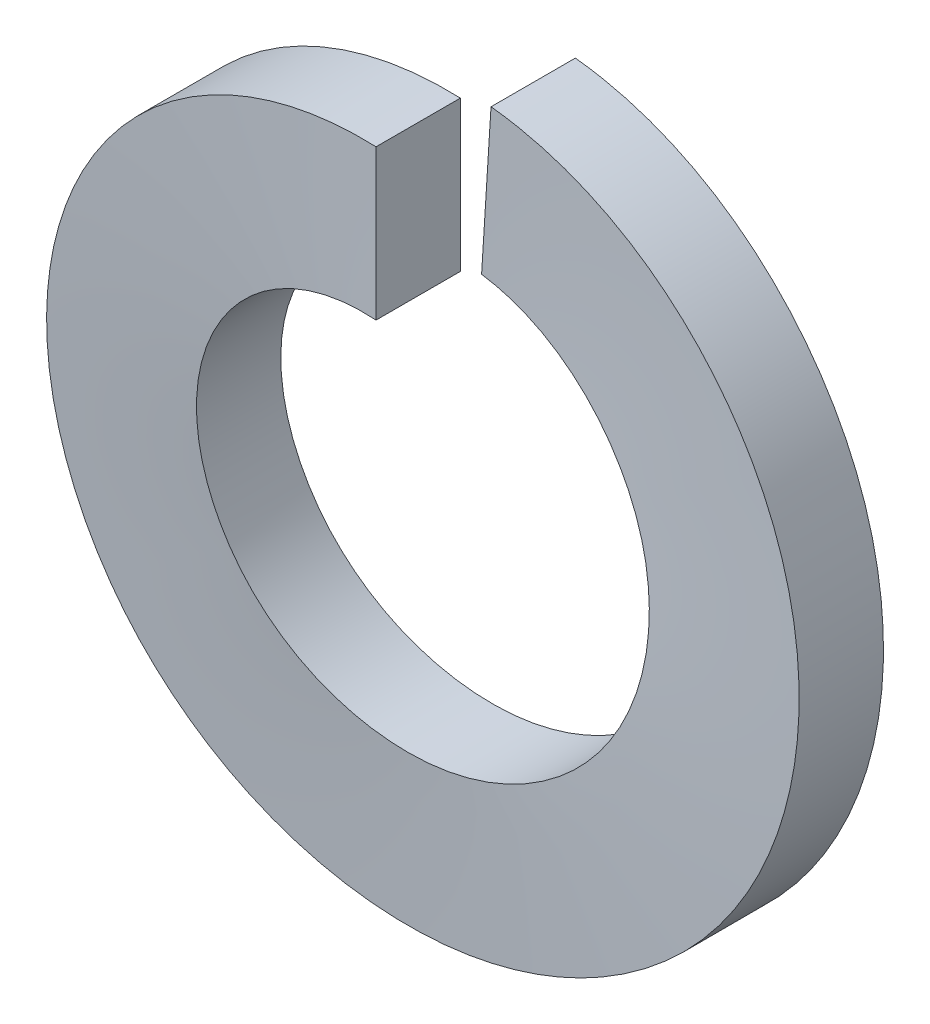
ISO-10303-21;
HEADER;
FILE_DESCRIPTION(('STEP AP214'),'2;1');
FILE_NAME('part.step','',(''),(''),'','','');
FILE_SCHEMA(('AUTOMOTIVE_DESIGN { 1 0 10303 214 1 1 1 1 }'));
ENDSEC;
DATA;
#1=APPLICATION_CONTEXT('core data for automotive mechanical design processes');
#2=APPLICATION_PROTOCOL_DEFINITION('international standard','automotive_design',2000,#1);
#3=PRODUCT_CONTEXT('',#1,'mechanical');
#4=PRODUCT('Part','Part','',(#3));
#5=PRODUCT_RELATED_PRODUCT_CATEGORY('part','',(#4));
#6=PRODUCT_DEFINITION_FORMATION('','',#4);
#7=PRODUCT_DEFINITION_CONTEXT('part definition',#1,'design');
#8=PRODUCT_DEFINITION('design','',#6,#7);
#9=PRODUCT_DEFINITION_SHAPE('','',#8);
#10=(LENGTH_UNIT() NAMED_UNIT(*) SI_UNIT(.MILLI.,.METRE.));
#11=(NAMED_UNIT(*) PLANE_ANGLE_UNIT() SI_UNIT($,.RADIAN.));
#12=(NAMED_UNIT(*) SI_UNIT($,.STERADIAN.) SOLID_ANGLE_UNIT());
#13=UNCERTAINTY_MEASURE_WITH_UNIT(LENGTH_MEASURE(1.E-05),#10,'distance_accuracy_value','');
#14=(GEOMETRIC_REPRESENTATION_CONTEXT(3) GLOBAL_UNCERTAINTY_ASSIGNED_CONTEXT((#13)) GLOBAL_UNIT_ASSIGNED_CONTEXT((#10,
#11,#12)) REPRESENTATION_CONTEXT('',''));
#15=CARTESIAN_POINT('',(0.,0.,0.));
#16=DIRECTION('',(0.,0.,1.));
#17=DIRECTION('',(1.,0.,0.));
#18=AXIS2_PLACEMENT_3D('',#15,#16,#17);
#19=CARTESIAN_POINT('',(0.,2.08915,0.635));
#20=DIRECTION('',(1.,0.,0.));
#21=DIRECTION('',(0.,0.,-1.));
#22=AXIS2_PLACEMENT_3D('',#19,#20,#21);
#23=PLANE('',#22);
#24=CARTESIAN_POINT('',(0.,2.6543,0.635));
#25=CARTESIAN_POINT('',(0.,1.524,0.635));
#26=(BOUNDED_CURVE() B_SPLINE_CURVE(1,(#24,#25),.UNSPECIFIED.,.F.,
.F.) B_SPLINE_CURVE_WITH_KNOTS((2,2),(0.,1.),
.UNSPECIFIED.) CURVE() GEOMETRIC_REPRESENTATION_ITEM() RATIONAL_B_SPLINE_CURVE((1.,1.)) REPRESENTATION_ITEM(''));
#27=CARTESIAN_POINT('',(0.,2.6543,0.635));
#28=VERTEX_POINT('',#27);
#29=CARTESIAN_POINT('',(0.,1.524,0.635));
#30=VERTEX_POINT('',#29);
#31=EDGE_CURVE('E53',#28,#30,#26,.T.);
#32=ORIENTED_EDGE('',*,*,#31,.T.);
#33=CARTESIAN_POINT('',(0.,1.524,0.635));
#34=CARTESIAN_POINT('',(0.,1.524,0.));
#35=(BOUNDED_CURVE() B_SPLINE_CURVE(1,(#33,#34),.UNSPECIFIED.,.F.,
.F.) B_SPLINE_CURVE_WITH_KNOTS((2,2),(0.,1.),
.UNSPECIFIED.) CURVE() GEOMETRIC_REPRESENTATION_ITEM() RATIONAL_B_SPLINE_CURVE((1.,1.)) REPRESENTATION_ITEM(''));
#36=CARTESIAN_POINT('',(0.,1.524,0.));
#37=VERTEX_POINT('',#36);
#38=EDGE_CURVE('E85',#30,#37,#35,.T.);
#39=ORIENTED_EDGE('',*,*,#38,.T.);
#40=CARTESIAN_POINT('',(0.,1.524,0.));
#41=CARTESIAN_POINT('',(0.,2.6543,0.));
#42=(BOUNDED_CURVE() B_SPLINE_CURVE(1,(#40,#41),.UNSPECIFIED.,.F.,
.F.) B_SPLINE_CURVE_WITH_KNOTS((2,2),(0.,1.),
.UNSPECIFIED.) CURVE() GEOMETRIC_REPRESENTATION_ITEM() RATIONAL_B_SPLINE_CURVE((1.,1.)) REPRESENTATION_ITEM(''));
#43=CARTESIAN_POINT('',(0.,2.6543,0.));
#44=VERTEX_POINT('',#43);
#45=EDGE_CURVE('E88',#37,#44,#42,.T.);
#46=ORIENTED_EDGE('',*,*,#45,.T.);
#47=CARTESIAN_POINT('',(0.,2.6543,0.));
#48=CARTESIAN_POINT('',(0.,2.6543,0.635));
#49=(BOUNDED_CURVE() B_SPLINE_CURVE(1,(#47,#48),.UNSPECIFIED.,.F.,
.F.) B_SPLINE_CURVE_WITH_KNOTS((2,2),(0.,1.),
.UNSPECIFIED.) CURVE() GEOMETRIC_REPRESENTATION_ITEM() RATIONAL_B_SPLINE_CURVE((1.,1.)) REPRESENTATION_ITEM(''));
#50=EDGE_CURVE('E68',#44,#28,#49,.T.);
#51=ORIENTED_EDGE('',*,*,#50,.T.);
#52=EDGE_LOOP('',(#32,#39,#46,#51));
#53=FACE_BOUND('',#52,.T.);
#54=ADVANCED_FACE('F42',(#53),#23,.T.);
#55=CARTESIAN_POINT('',(0.113450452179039,1.80300921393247,-0.0640442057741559));
#56=DIRECTION('',(0.998026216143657,-0.0627986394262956,5.2689467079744E-05));
#57=DIRECTION('',(0.0627986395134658,0.998026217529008,0.));
#58=AXIS2_PLACEMENT_3D('',#55,#56,#57);
#59=PLANE('',#58);
#60=CARTESIAN_POINT('',(0.166686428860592,2.64906098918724,-0.0640442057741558));
#61=CARTESIAN_POINT('',(0.0957051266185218,1.52099195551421,-0.0640442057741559));
#62=(BOUNDED_CURVE() B_SPLINE_CURVE(1,(#60,#61),.UNSPECIFIED.,.F.,
.F.) B_SPLINE_CURVE_WITH_KNOTS((2,2),(0.,1.),
.UNSPECIFIED.) CURVE() GEOMETRIC_REPRESENTATION_ITEM() RATIONAL_B_SPLINE_CURVE((0.984338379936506,0.984338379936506)) REPRESENTATION_ITEM(''));
#63=CARTESIAN_POINT('',(0.0957176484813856,1.52099116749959,-0.0640433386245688));
#64=VERTEX_POINT('',#63);
#65=CARTESIAN_POINT('',(0.166686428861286,2.6490609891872,-0.0640442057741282));
#66=VERTEX_POINT('',#65);
#67=EDGE_CURVE('E12',#64,#66,#62,.F.);
#68=ORIENTED_EDGE('',*,*,#67,.T.);
#69=CARTESIAN_POINT('',(0.166686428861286,2.6490609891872,-0.699044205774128));
#70=CARTESIAN_POINT('',(0.166686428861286,2.6490609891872,-0.0640442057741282));
#71=(BOUNDED_CURVE() B_SPLINE_CURVE(1,(#69,#70),.UNSPECIFIED.,.F.,
.F.) B_SPLINE_CURVE_WITH_KNOTS((2,2),(0.,1.),
.UNSPECIFIED.) CURVE() GEOMETRIC_REPRESENTATION_ITEM() RATIONAL_B_SPLINE_CURVE((0.984338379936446,0.984338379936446)) REPRESENTATION_ITEM(''));
#72=CARTESIAN_POINT('',(0.166708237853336,2.64905961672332,-0.699043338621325));
#73=VERTEX_POINT('',#72);
#74=EDGE_CURVE('E130',#66,#73,#71,.F.);
#75=ORIENTED_EDGE('',*,*,#74,.T.);
#76=CARTESIAN_POINT('',(0.0957301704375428,1.52099037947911,-0.699042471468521));
#77=CARTESIAN_POINT('',(0.166730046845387,2.64905824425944,-0.699042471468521));
#78=(BOUNDED_CURVE() B_SPLINE_CURVE(1,(#76,#77),.UNSPECIFIED.,.F.,
.F.) B_SPLINE_CURVE_WITH_KNOTS((2,2),(0.,1.),
.UNSPECIFIED.) CURVE() GEOMETRIC_REPRESENTATION_ITEM() RATIONAL_B_SPLINE_CURVE((0.984334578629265,0.984334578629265)) REPRESENTATION_ITEM(''));
#79=CARTESIAN_POINT('',(0.0957301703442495,1.52099037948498,-0.699042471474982));
#80=VERTEX_POINT('',#79);
#81=EDGE_CURVE('E108',#73,#80,#78,.F.);
#82=ORIENTED_EDGE('',*,*,#81,.T.);
#83=CARTESIAN_POINT('',(0.0957301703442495,1.52099037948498,-0.0640424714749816));
#84=CARTESIAN_POINT('',(0.0957301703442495,1.52099037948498,-0.699042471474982));
#85=(BOUNDED_CURVE() B_SPLINE_CURVE(1,(#83,#84),.UNSPECIFIED.,.F.,
.F.) B_SPLINE_CURVE_WITH_KNOTS((2,2),(0.,1.),
.UNSPECIFIED.) CURVE() GEOMETRIC_REPRESENTATION_ITEM() RATIONAL_B_SPLINE_CURVE((0.984334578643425,0.984334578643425)) REPRESENTATION_ITEM(''));
#86=EDGE_CURVE('E93',#80,#64,#85,.F.);
#87=ORIENTED_EDGE('',*,*,#86,.T.);
#88=EDGE_LOOP('',(#68,#75,#82,#87));
#89=FACE_BOUND('',#88,.T.);
#90=ADVANCED_FACE('F44',(#89),#59,.F.);
#91=CARTESIAN_POINT('',(0.,2.6543,0.635));
#92=CARTESIAN_POINT('',(-1.53246081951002,2.6543,0.576203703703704));
#93=CARTESIAN_POINT('',(-2.29869122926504,1.32715,0.517407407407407));
#94=CARTESIAN_POINT('',(-3.06492163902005,0.,0.458611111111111));
#95=CARTESIAN_POINT('',(-2.29869122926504,-1.32715,0.399814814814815));
#96=CARTESIAN_POINT('',(-1.53246081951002,-2.6543,0.341018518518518));
#97=CARTESIAN_POINT('',(0.,-2.6543,0.282222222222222));
#98=CARTESIAN_POINT('',(1.53246081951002,-2.6543,0.223425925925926));
#99=CARTESIAN_POINT('',(2.29869122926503,-1.32715,0.16462962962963));
#100=CARTESIAN_POINT('',(3.06492163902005,0.,0.105833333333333));
#101=CARTESIAN_POINT('',(2.29869122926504,1.32715,0.0470370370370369));
#102=CARTESIAN_POINT('',(1.58708659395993,2.55968538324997,-0.00756757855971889));
#103=CARTESIAN_POINT('',(0.166686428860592,2.64906098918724,-0.0640442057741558));
#104=CARTESIAN_POINT('',(0.,1.524,0.635));
#105=CARTESIAN_POINT('',(-0.87988181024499,1.524,0.576203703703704));
#106=CARTESIAN_POINT('',(-1.31982271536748,0.762,0.517407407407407));
#107=CARTESIAN_POINT('',(-1.75976362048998,0.,0.458611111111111));
#108=CARTESIAN_POINT('',(-1.31982271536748,-0.762,0.399814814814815));
#109=CARTESIAN_POINT('',(-0.87988181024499,-1.524,0.341018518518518));
#110=CARTESIAN_POINT('',(0.,-1.524,0.282222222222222));
#111=CARTESIAN_POINT('',(0.879881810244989,-1.524,0.223425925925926));
#112=CARTESIAN_POINT('',(1.31982271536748,-0.762000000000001,0.164629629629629));
#113=CARTESIAN_POINT('',(1.75976362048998,0.,0.105833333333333));
#114=CARTESIAN_POINT('',(1.31982271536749,0.761999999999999,0.0470370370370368));
#115=CARTESIAN_POINT('',(0.911245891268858,1.46967581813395,-0.00756757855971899));
#116=CARTESIAN_POINT('',(0.0957051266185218,1.52099195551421,-0.0640442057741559));
#117=(BOUNDED_SURFACE() B_SPLINE_SURFACE(1,2,((#91,#92,#93,#94,#95,#96,#97,#98,#99,#100,#101,
#102,#103),(#104,#105,#106,#107,#108,#109,#110,#111,#112,#113,#114,#115,#116)),.UNSPECIFIED.,
.F.,.F.,.F.) B_SPLINE_SURFACE_WITH_KNOTS((2,2),(3,2,2,2,2,2,3),(0.,1.),(0.,0.166666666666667,
0.333333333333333,0.5,0.666666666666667,0.833333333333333,0.989610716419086),
.UNSPECIFIED.) GEOMETRIC_REPRESENTATION_ITEM() RATIONAL_B_SPLINE_SURFACE(((1.,0.866025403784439,
1.,0.866025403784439,1.,0.866025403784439,1.,0.866025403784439,1.,0.866025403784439,1.,
0.87437680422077,0.984338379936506),(1.,0.866025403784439,1.,0.866025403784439,1.,
0.866025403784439,1.,0.866025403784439,1.,0.866025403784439,1.,0.87437680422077,0.984338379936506))) REPRESENTATION_ITEM('') SURFACE());
#118=CARTESIAN_POINT('',(0.,2.6543,0.635));
#119=CARTESIAN_POINT('',(-1.53246081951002,2.6543,0.576203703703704));
#120=CARTESIAN_POINT('',(-2.29869122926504,1.32715,0.517407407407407));
#121=CARTESIAN_POINT('',(-3.06492163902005,0.,0.458611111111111));
#122=CARTESIAN_POINT('',(-2.29869122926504,-1.32715,0.399814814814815));
#123=CARTESIAN_POINT('',(-1.53246081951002,-2.6543,0.341018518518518));
#124=CARTESIAN_POINT('',(0.,-2.6543,0.282222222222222));
#125=CARTESIAN_POINT('',(1.53246081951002,-2.6543,0.223425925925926));
#126=CARTESIAN_POINT('',(2.29869122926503,-1.32715,0.16462962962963));
#127=CARTESIAN_POINT('',(3.06492163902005,0.,0.105833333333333));
#128=CARTESIAN_POINT('',(2.29869122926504,1.32715,0.0470370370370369));
#129=CARTESIAN_POINT('',(1.58708659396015,2.55968538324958,-0.00756757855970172));
#130=CARTESIAN_POINT('',(0.166686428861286,2.6490609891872,-0.0640442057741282));
#131=(BOUNDED_CURVE() B_SPLINE_CURVE(2,(#118,#119,#120,#121,#122,#123,#124,#125,#126,#127,#128,
#129,#130),.UNSPECIFIED.,.F.,.F.) B_SPLINE_CURVE_WITH_KNOTS((3,2,2,2,2,2,3),(0.,
0.166666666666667,0.333333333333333,0.5,0.666666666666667,0.833333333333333,0.989610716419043),
.UNSPECIFIED.) CURVE() GEOMETRIC_REPRESENTATION_ITEM() RATIONAL_B_SPLINE_CURVE((1.,
0.866025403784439,1.,0.866025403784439,1.,0.866025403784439,1.,0.866025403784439,1.,
0.866025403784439,1.,0.874376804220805,0.984338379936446)) REPRESENTATION_ITEM(''));
#132=EDGE_CURVE('E60',#28,#66,#131,.T.);
#133=CARTESIAN_POINT('',(0.,1.524,0.635));
#134=CARTESIAN_POINT('',(-0.0271195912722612,1.52400073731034,0.633187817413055));
#135=CARTESIAN_POINT('',(-0.0542372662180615,1.52327614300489,0.631347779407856));
#136=CARTESIAN_POINT('',(-0.108746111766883,1.52036321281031,0.627592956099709));
#137=CARTESIAN_POINT('',(-0.136136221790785,1.5181558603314,0.625677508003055));
#138=CARTESIAN_POINT('',(-0.191072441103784,1.51223002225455,0.621777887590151));
#139=CARTESIAN_POINT('',(-0.218616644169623,1.50849421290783,0.619793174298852));
#140=CARTESIAN_POINT('',(-0.273736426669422,1.49947728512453,0.615762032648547));
#141=CARTESIAN_POINT('',(-0.301309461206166,1.49418079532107,0.613715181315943));
#142=CARTESIAN_POINT('',(-0.35635661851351,1.48202137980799,0.609567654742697));
#143=CARTESIAN_POINT('',(-0.383827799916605,1.47514524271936,0.607466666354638));
#144=CARTESIAN_POINT('',(-0.438537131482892,1.45981982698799,0.603219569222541));
#145=CARTESIAN_POINT('',(-0.465772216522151,1.45135966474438,0.601073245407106));
#146=CARTESIAN_POINT('',(-0.519873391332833,1.43287450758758,0.59674488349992));
#147=CARTESIAN_POINT('',(-0.546736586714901,1.42284107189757,0.594562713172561));
#148=CARTESIAN_POINT('',(-0.599958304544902,1.40123308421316,0.590172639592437));
#149=CARTESIAN_POINT('',(-0.626314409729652,1.38965259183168,0.58796466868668));
#150=CARTESIAN_POINT('',(-0.67838875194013,1.36498961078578,0.583533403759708));
#151=CARTESIAN_POINT('',(-0.704105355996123,1.35190367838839,0.581310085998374));
#152=CARTESIAN_POINT('',(-0.754772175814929,1.32428397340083,0.576858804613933));
#153=CARTESIAN_POINT('',(-0.779721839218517,1.30974918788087,0.574630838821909));
#154=CARTESIAN_POINT('',(-0.828733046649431,1.27930022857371,0.570181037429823));
#155=CARTESIAN_POINT('',(-0.85279539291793,1.2633873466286,0.567959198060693));
#156=CARTESIAN_POINT('',(-0.899918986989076,1.23026385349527,0.563532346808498));
#157=CARTESIAN_POINT('',(-0.922982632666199,1.21305665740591,0.561327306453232));
#158=CARTESIAN_POINT('',(-0.968006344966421,1.17743799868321,0.556944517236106));
#159=CARTESIAN_POINT('',(-0.989970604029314,1.15903184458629,0.554766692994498));
#160=CARTESIAN_POINT('',(-1.03270503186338,1.12111887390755,0.550448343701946));
#161=CARTESIAN_POINT('',(-1.05348133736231,1.10161899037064,0.548307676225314));
#162=CARTESIAN_POINT('',(-1.09376247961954,1.06163042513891,0.544073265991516));
#163=CARTESIAN_POINT('',(-1.11327549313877,1.04115000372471,0.541979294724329));
#164=CARTESIAN_POINT('',(-1.15096659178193,0.999318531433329,0.537846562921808));
#165=CARTESIAN_POINT('',(-1.16915493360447,0.977976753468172,0.535807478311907));
#166=CARTESIAN_POINT('',(-1.20414769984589,0.934544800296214,0.531794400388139));
#167=CARTESIAN_POINT('',(-1.22096444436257,0.912464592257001,0.529819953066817));
#168=CARTESIAN_POINT('',(-1.25317924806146,0.867680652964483,0.525936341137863));
#169=CARTESIAN_POINT('',(-1.26859162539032,0.844987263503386,0.524026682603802));
#170=CARTESIAN_POINT('',(-1.29798214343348,0.799094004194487,0.520303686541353));
#171=CARTESIAN_POINT('',(-1.31197614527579,0.775904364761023,0.518489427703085));
#172=CARTESIAN_POINT('',(-1.33875481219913,0.72873160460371,0.514831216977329));
#173=CARTESIAN_POINT('',(-1.35153508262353,0.704745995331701,0.512987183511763));
#174=CARTESIAN_POINT('',(-1.37594992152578,0.655816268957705,0.509216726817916));
#175=CARTESIAN_POINT('',(-1.38756760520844,0.630863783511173,0.507289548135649));
#176=CARTESIAN_POINT('',(-1.40955942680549,0.5800798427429,0.503369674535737));
#177=CARTESIAN_POINT('',(-1.41991778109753,0.554241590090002,0.501376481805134));
#178=CARTESIAN_POINT('',(-1.43929982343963,0.50177865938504,0.497328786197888));
#179=CARTESIAN_POINT('',(-1.44830913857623,0.475148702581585,0.495273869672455));
#180=CARTESIAN_POINT('',(-1.46491108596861,0.421206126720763,0.49111153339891));
#181=CARTESIAN_POINT('',(-1.47249105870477,0.393889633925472,0.489003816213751));
#182=CARTESIAN_POINT('',(-1.48616300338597,0.338688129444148,0.484744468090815));
#183=CARTESIAN_POINT('',(-1.49224430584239,0.310800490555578,0.48259263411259));
#184=CARTESIAN_POINT('',(-1.50285990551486,0.254579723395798,0.478254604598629));
#185=CARTESIAN_POINT('',(-1.50738576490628,0.226245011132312,0.476068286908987));
#186=CARTESIAN_POINT('',(-1.51484512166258,0.169260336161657,0.471671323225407));
#187=CARTESIAN_POINT('',(-1.51777260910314,0.140609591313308,0.469460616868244));
#188=CARTESIAN_POINT('',(-1.5220045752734,0.0831283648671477,0.465025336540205));
#189=CARTESIAN_POINT('',(-1.52330561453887,0.0542976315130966,0.462800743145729));
#190=CARTESIAN_POINT('',(-1.52426947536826,-0.00340488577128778,0.458348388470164));
#191=CARTESIAN_POINT('',(-1.52393151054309,-0.0322766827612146,0.456120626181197));
#192=CARTESIAN_POINT('',(-1.5216179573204,-0.0899216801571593,0.451672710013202));
#193=CARTESIAN_POINT('',(-1.51964425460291,-0.118694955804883,0.449452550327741));
#194=CARTESIAN_POINT('',(-1.51407560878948,-0.176004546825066,0.445030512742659));
#195=CARTESIAN_POINT('',(-1.51048517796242,-0.204541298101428,0.442828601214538));
#196=CARTESIAN_POINT('',(-1.5017148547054,-0.261242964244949,0.438453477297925));
#197=CARTESIAN_POINT('',(-1.49654199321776,-0.289408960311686,0.436280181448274));
#198=CARTESIAN_POINT('',(-1.48465323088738,-0.345239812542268,0.431972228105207));
#199=CARTESIAN_POINT('',(-1.47794671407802,-0.372906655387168,0.429837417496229));
#200=CARTESIAN_POINT('',(-1.46305061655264,-0.427617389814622,0.425615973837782));
#201=CARTESIAN_POINT('',(-1.45487255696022,-0.454664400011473,0.423529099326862));
#202=CARTESIAN_POINT('',(-1.43710556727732,-0.508022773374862,0.419411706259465));
#203=CARTESIAN_POINT('',(-1.42753003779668,-0.534338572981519,0.417380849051));
#204=CARTESIAN_POINT('',(-1.40705082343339,-0.586132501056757,0.413385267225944));
#205=CARTESIAN_POINT('',(-1.39616213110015,-0.611616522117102,0.411420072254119));
#206=CARTESIAN_POINT('',(-1.373148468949,-0.661655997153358,0.407555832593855));
#207=CARTESIAN_POINT('',(-1.36103977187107,-0.686218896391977,0.405656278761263));
#208=CARTESIAN_POINT('',(-1.33567026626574,-0.734365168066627,0.401952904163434));
#209=CARTESIAN_POINT('',(-1.32242533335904,-0.757956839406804,0.400148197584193));
#210=CARTESIAN_POINT('',(-1.29461080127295,-0.804549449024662,0.396485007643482));
#211=CARTESIAN_POINT('',(-1.28003320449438,-0.827545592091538,0.394626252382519));
#212=CARTESIAN_POINT('',(-1.24947687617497,-0.873008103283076,0.390832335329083));
#213=CARTESIAN_POINT('',(-1.23348270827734,-0.895464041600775,0.388896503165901));
#214=CARTESIAN_POINT('',(-1.20011532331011,-0.939721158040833,0.384958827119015));
#215=CARTESIAN_POINT('',(-1.18272860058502,-0.961512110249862,0.382956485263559));
#216=CARTESIAN_POINT('',(-1.14661260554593,-1.00431433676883,0.378891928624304));
#217=CARTESIAN_POINT('',(-1.12787185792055,-1.0253158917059,0.376829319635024));
#218=CARTESIAN_POINT('',(-1.08909865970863,-1.06641682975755,0.372652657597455));
#219=CARTESIAN_POINT('',(-1.06905681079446,-1.08650731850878,0.3705383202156));
#220=CARTESIAN_POINT('',(-1.02774653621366,-1.1256680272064,0.366267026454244));
#221=CARTESIAN_POINT('',(-1.00647078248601,-1.14473049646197,0.364109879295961));
#222=CARTESIAN_POINT('',(-0.962771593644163,-1.18172356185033,0.359762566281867));
#223=CARTESIAN_POINT('',(-0.940342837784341,-1.19964785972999,0.357572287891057));
#224=CARTESIAN_POINT('',(-0.89442946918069,-1.23426146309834,0.353168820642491));
#225=CARTESIAN_POINT('',(-0.870941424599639,-1.25094620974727,0.350955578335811));
#226=CARTESIAN_POINT('',(-0.823013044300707,-1.28298793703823,0.346516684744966));
#227=CARTESIAN_POINT('',(-0.798570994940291,-1.29834235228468,0.344291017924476));
#228=CARTESIAN_POINT('',(-0.748848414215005,-1.32764263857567,0.339837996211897));
#229=CARTESIAN_POINT('',(-0.723567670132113,-1.34158814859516,0.337610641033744));
#230=CARTESIAN_POINT('',(-0.672289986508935,-1.36800322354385,0.333165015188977));
#231=CARTESIAN_POINT('',(-0.646294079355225,-1.38047479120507,0.330946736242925));
#232=CARTESIAN_POINT('',(-0.593714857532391,-1.40388902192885,0.326529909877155));
#233=CARTESIAN_POINT('',(-0.567133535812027,-1.41483615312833,0.324331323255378));
#234=CARTESIAN_POINT('',(-0.513516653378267,-1.43516370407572,0.319964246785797));
#235=CARTESIAN_POINT('',(-0.486483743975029,-1.44455109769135,0.317795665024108));
#236=CARTESIAN_POINT('',(-0.432099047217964,-1.46173685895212,0.313498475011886));
#237=CARTESIAN_POINT('',(-0.404750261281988,-1.46954468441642,0.311369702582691));
#238=CARTESIAN_POINT('',(-0.349869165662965,-1.48356445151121,0.307161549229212));
#239=CARTESIAN_POINT('',(-0.322339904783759,-1.48978825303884,0.305081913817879));
#240=CARTESIAN_POINT('',(-0.267231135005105,-1.50064817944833,0.300980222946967));
#241=CARTESIAN_POINT('',(-0.239654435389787,-1.50529842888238,0.298957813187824));
#242=CARTESIAN_POINT('',(-0.184579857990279,-1.51303378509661,0.294979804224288));
#243=CARTESIAN_POINT('',(-0.157084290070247,-1.51613509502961,0.293023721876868));
#244=CARTESIAN_POINT('',(-0.102295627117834,-1.52080846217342,0.289179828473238));
#245=CARTESIAN_POINT('',(-0.075004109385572,-1.52239857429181,0.287291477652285));
#246=CARTESIAN_POINT('',(-0.020672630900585,-1.52409942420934,0.283604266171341));
#247=CARTESIAN_POINT('',(0.00636677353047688,-1.52422632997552,0.281804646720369));
#248=CARTESIAN_POINT('',(0.0606502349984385,-1.52303683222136,0.278133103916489));
#249=CARTESIAN_POINT('',(0.0878939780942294,-1.52170760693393,0.27626068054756));
#250=CARTESIAN_POINT('',(0.142607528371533,-1.51756420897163,0.272444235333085));
#251=CARTESIAN_POINT('',(0.170075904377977,-1.51473168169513,0.270499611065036));
#252=CARTESIAN_POINT('',(0.22511808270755,-1.5075399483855,0.266544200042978));
#253=CARTESIAN_POINT('',(0.252689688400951,-1.50316419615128,0.264532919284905));
#254=CARTESIAN_POINT('',(0.307811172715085,-1.49285697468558,0.260451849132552));
#255=CARTESIAN_POINT('',(0.335358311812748,-1.48691100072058,0.258381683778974));
#256=CARTESIAN_POINT('',(0.390298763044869,-1.47344807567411,0.254191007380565));
#257=CARTESIAN_POINT('',(0.417689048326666,-1.46591885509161,0.252070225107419));
#258=CARTESIAN_POINT('',(0.472180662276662,-1.44928884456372,0.247787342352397));
#259=CARTESIAN_POINT('',(0.499278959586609,-1.44017816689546,0.245625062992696));
#260=CARTESIAN_POINT('',(0.553050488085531,-1.4203998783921,0.241268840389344));
#261=CARTESIAN_POINT('',(0.579720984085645,-1.40972485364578,0.239074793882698));
#262=CARTESIAN_POINT('',(0.63250198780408,-1.38684795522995,0.234665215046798));
#263=CARTESIAN_POINT('',(0.658610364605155,-1.37464117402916,0.232449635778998));
#264=CARTESIAN_POINT('',(0.710135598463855,-1.34874614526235,0.228007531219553));
#265=CARTESIAN_POINT('',(0.73555123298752,-1.3350554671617,0.225780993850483));
#266=CARTESIAN_POINT('',(0.785565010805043,-1.30625280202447,0.221327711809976));
#267=CARTESIAN_POINT('',(0.810163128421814,-1.29114077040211,0.219100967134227));
#268=CARTESIAN_POINT('',(0.858423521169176,-1.25956944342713,0.214658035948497));
#269=CARTESIAN_POINT('',(0.882087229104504,-1.24311233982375,0.21244183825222));
#270=CARTESIAN_POINT('',(0.928369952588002,-1.2089375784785,0.208030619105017));
#271=CARTESIAN_POINT('',(0.950992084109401,-1.19122414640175,0.205835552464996));
#272=CARTESIAN_POINT('',(0.995093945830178,-1.15463458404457,0.201476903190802));
#273=CARTESIAN_POINT('',(1.01657865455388,-1.13576446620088,0.199313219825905));
#274=CARTESIAN_POINT('',(1.0583204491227,-1.09696877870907,0.195027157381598));
#275=CARTESIAN_POINT('',(1.07858450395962,-1.07705072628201,0.192904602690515));
#276=CARTESIAN_POINT('',(1.11781327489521,-1.03627386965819,0.188710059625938));
#277=CARTESIAN_POINT('',(1.136787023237,-1.01542378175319,0.186637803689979));
#278=CARTESIAN_POINT('',(1.17337763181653,-0.972902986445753,0.18255217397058));
#279=CARTESIAN_POINT('',(1.1910056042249,-0.951241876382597,0.18053842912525));
#280=CARTESIAN_POINT('',(1.22486160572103,-0.907222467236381,0.176578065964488));
#281=CARTESIAN_POINT('',(1.24110278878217,-0.884874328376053,0.174630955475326));
#282=CARTESIAN_POINT('',(1.27215654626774,-0.839605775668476,0.17080837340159));
#283=CARTESIAN_POINT('',(1.28698422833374,-0.816695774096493,0.168932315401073));
#284=CARTESIAN_POINT('',(1.31525727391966,-0.77032761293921,0.165257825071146));
#285=CARTESIAN_POINT('',(1.32871428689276,-0.746876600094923,0.163458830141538));
#286=CARTESIAN_POINT('',(1.35449814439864,-0.699040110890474,0.159775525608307));
#287=CARTESIAN_POINT('',(1.3668112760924,-0.674647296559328,0.157890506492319));
#288=CARTESIAN_POINT('',(1.39025103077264,-0.62493400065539,0.154052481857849));
#289=CARTESIAN_POINT('',(1.4013611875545,-0.599605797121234,0.152098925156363));
#290=CARTESIAN_POINT('',(1.42229936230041,-0.548107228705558,0.14812584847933));
#291=CARTESIAN_POINT('',(1.43211213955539,-0.521930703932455,0.146105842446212));
#292=CARTESIAN_POINT('',(1.45036805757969,-0.46883262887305,0.142008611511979));
#293=CARTESIAN_POINT('',(1.45879749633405,-0.441906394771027,0.139931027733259));
#294=CARTESIAN_POINT('',(1.47420890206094,-0.387417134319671,0.135726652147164));
#295=CARTESIAN_POINT('',(1.48117899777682,-0.359850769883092,0.133599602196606));
#296=CARTESIAN_POINT('',(1.49360530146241,-0.304199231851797,0.129305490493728));
#297=CARTESIAN_POINT('',(1.499051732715,-0.276111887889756,0.127138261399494));
#298=CARTESIAN_POINT('',(1.50837717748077,-0.219544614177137,0.122773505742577));
#299=CARTESIAN_POINT('',(1.51224873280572,-0.191063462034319,0.12057588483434));
#300=CARTESIAN_POINT('',(1.51838502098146,-0.133841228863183,0.116160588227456));
#301=CARTESIAN_POINT('',(1.52064478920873,-0.10509961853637,0.113942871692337));
#302=CARTESIAN_POINT('',(1.52353315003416,-0.0474935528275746,0.10949795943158));
#303=CARTESIAN_POINT('',(1.52415939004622,-0.0186289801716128,0.107270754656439));
#304=CARTESIAN_POINT('',(1.5237719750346,0.0390836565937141,0.102817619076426));
#305=CARTESIAN_POINT('',(1.52275863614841,0.0679317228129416,0.100591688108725));
#306=CARTESIAN_POINT('',(1.51909918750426,0.125471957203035,0.0961518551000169));
#307=CARTESIAN_POINT('',(1.51645605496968,0.154164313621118,0.0939379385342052));
#308=CARTESIAN_POINT('',(1.50955981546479,0.211255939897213,0.0895327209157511));
#309=CARTESIAN_POINT('',(1.50531227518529,0.239655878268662,0.0873413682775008));
#310=CARTESIAN_POINT('',(1.49524514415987,0.296029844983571,0.0829915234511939));
#311=CARTESIAN_POINT('',(1.48943357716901,0.324005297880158,0.0808329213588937));
#312=CARTESIAN_POINT('',(1.47629054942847,0.379403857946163,0.0765583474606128));
#313=CARTESIAN_POINT('',(1.46896938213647,0.406829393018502,0.0744421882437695));
#314=CARTESIAN_POINT('',(1.45287234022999,0.461009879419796,0.0702615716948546));
#315=CARTESIAN_POINT('',(1.44410879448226,0.487768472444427,0.0681968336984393));
#316=CARTESIAN_POINT('',(1.42520374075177,0.540506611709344,0.0641276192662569));
#317=CARTESIAN_POINT('',(1.41507632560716,0.566491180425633,0.0621227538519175));
#318=CARTESIAN_POINT('',(1.39353019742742,0.61758377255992,0.0581801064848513));
#319=CARTESIAN_POINT('',(1.38212704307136,0.642698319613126,0.0562418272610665));
#320=CARTESIAN_POINT('',(1.35812412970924,0.691965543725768,0.0524415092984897));
#321=CARTESIAN_POINT('',(1.34554108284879,0.716126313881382,0.0505788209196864));
#322=CARTESIAN_POINT('',(1.31919116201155,0.763571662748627,0.0469136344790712));
#323=CARTESIAN_POINT('',(1.30543337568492,0.786861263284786,0.0451108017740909));
#324=CARTESIAN_POINT('',(1.27652717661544,0.832948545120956,0.0414122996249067));
#325=CARTESIAN_POINT('',(1.2613639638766,0.855736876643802,0.0395157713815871));
#326=CARTESIAN_POINT('',(1.22964359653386,0.900732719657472,0.0356571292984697));
#327=CARTESIAN_POINT('',(1.21307178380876,0.922929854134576,0.033694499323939));
#328=CARTESIAN_POINT('',(1.17856246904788,0.966617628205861,0.0297038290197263));
#329=CARTESIAN_POINT('',(1.16061228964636,0.988098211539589,0.0276753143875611));
#330=CARTESIAN_POINT('',(1.12338857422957,1.03022884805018,0.0235622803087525));
#331=CARTESIAN_POINT('',(1.10410441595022,1.05086948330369,0.0214774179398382));
#332=CARTESIAN_POINT('',(1.06426953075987,1.09119925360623,0.0172596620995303));
#333=CARTESIAN_POINT('',(1.04371026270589,1.11087992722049,0.0151265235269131));
#334=CARTESIAN_POINT('',(1.001396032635,1.14917411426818,0.010821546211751));
#335=CARTESIAN_POINT('',(0.979634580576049,1.16778043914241,0.00864955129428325));
#336=CARTESIAN_POINT('',(0.935000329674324,1.20381758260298,0.00427664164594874));
#337=CARTESIAN_POINT('',(0.912123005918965,1.22124278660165,0.00207564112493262));
#338=CARTESIAN_POINT('',(0.865353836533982,1.25481861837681,-0.00234497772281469));
#339=CARTESIAN_POINT('',(0.841459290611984,1.27096548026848,-0.0045646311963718));
#340=CARTESIAN_POINT('',(0.792763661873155,1.30189661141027,-0.00901194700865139));
#341=CARTESIAN_POINT('',(0.767961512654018,1.31667920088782,-0.0112396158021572));
#342=CARTESIAN_POINT('',(0.717568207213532,1.34480637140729,-0.0156921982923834));
#343=CARTESIAN_POINT('',(0.691977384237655,1.35815154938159,-0.0179171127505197));
#344=CARTESIAN_POINT('',(0.640131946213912,1.38334233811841,-0.0223534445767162));
#345=CARTESIAN_POINT('',(0.613878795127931,1.3951909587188,-0.0245648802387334));
#346=CARTESIAN_POINT('',(0.560839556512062,1.41734185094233,-0.0289637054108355));
#347=CARTESIAN_POINT('',(0.53405577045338,1.42764962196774,-0.0311511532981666));
#348=CARTESIAN_POINT('',(0.48008960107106,1.44668737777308,-0.0354918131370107));
#349=CARTESIAN_POINT('',(0.452910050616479,1.45542536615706,-0.0376451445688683));
#350=CARTESIAN_POINT('',(0.398287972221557,1.47130761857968,-0.0419078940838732));
#351=CARTESIAN_POINT('',(0.37084850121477,1.4784623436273,-0.0440175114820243));
#352=CARTESIAN_POINT('',(0.315841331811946,1.49117755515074,-0.0481838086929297));
#353=CARTESIAN_POINT('',(0.288276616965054,1.49675085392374,-0.0502407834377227));
#354=CARTESIAN_POINT('',(0.233150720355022,1.50631717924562,-0.0542935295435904));
#355=CARTESIAN_POINT('',(0.205592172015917,1.51032521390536,-0.0562897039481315));
#356=CARTESIAN_POINT('',(0.150605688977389,1.51679010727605,-0.0602134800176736));
#357=CARTESIAN_POINT('',(0.123179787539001,1.51926395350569,-0.0621416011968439));
#358=CARTESIAN_POINT('',(0.0957051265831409,1.52099195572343,-0.0640442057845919));
#359=B_SPLINE_CURVE_WITH_KNOTS('',3,(#133,#134,#135,#136,#137,#138,#139,#140,#141,#142,#143,
#144,#145,#146,#147,#148,#149,#150,#151,#152,#153,#154,#155,#156,#157,#158,#159,#160,#161,#162,
#163,#164,#165,#166,#167,#168,#169,#170,#171,#172,#173,#174,#175,#176,#177,#178,#179,#180,#181,
#182,#183,#184,#185,#186,#187,#188,#189,#190,#191,#192,#193,#194,#195,#196,#197,#198,#199,#200,
#201,#202,#203,#204,#205,#206,#207,#208,#209,#210,#211,#212,#213,#214,#215,#216,#217,#218,#219,
#220,#221,#222,#223,#224,#225,#226,#227,#228,#229,#230,#231,#232,#233,#234,#235,#236,#237,#238,
#239,#240,#241,#242,#243,#244,#245,#246,#247,#248,#249,#250,#251,#252,#253,#254,#255,#256,#257,
#258,#259,#260,#261,#262,#263,#264,#265,#266,#267,#268,#269,#270,#271,#272,#273,#274,#275,#276,
#277,#278,#279,#280,#281,#282,#283,#284,#285,#286,#287,#288,#289,#290,#291,#292,#293,#294,#295,
#296,#297,#298,#299,#300,#301,#302,#303,#304,#305,#306,#307,#308,#309,#310,#311,#312,#313,#314,
#315,#316,#317,#318,#319,#320,#321,#322,#323,#324,#325,#326,#327,#328,#329,#330,#331,#332,#333,
#334,#335,#336,#337,#338,#339,#340,#341,#342,#343,#344,#345,#346,#347,#348,#349,#350,#351,#352,
#353,#354,#355,#356,#357,#358),.UNSPECIFIED.,.F.,.F.,(4,2,2,2,2,2,2,2,2,2,2,2,2,2,2,2,2,2,2,2,2,
2,2,2,2,2,2,2,2,2,2,2,2,2,2,2,2,2,2,2,2,2,2,2,2,2,2,2,2,2,2,2,2,2,2,2,2,2,2,2,2,2,2,2,2,2,2,2,2,
2,2,2,2,2,2,2,2,2,2,2,2,2,2,2,2,2,2,2,2,2,2,2,2,2,2,2,2,2,2,2,2,2,2,2,2,2,2,2,2,2,2,2,4),(0.,
0.0815305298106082,0.164127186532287,0.247687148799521,0.332099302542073,0.41724494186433,
0.502998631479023,0.589229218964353,0.675800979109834,0.76257486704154,0.849409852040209,
0.936164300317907,1.02269737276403,1.10887040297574,1.19454822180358,1.27960039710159,
1.36390236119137,1.44733640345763,1.52979251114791,1.61119095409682,1.69287370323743,
1.77560896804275,1.85929275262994,1.94381285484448,2.0290495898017,2.11487667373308,
2.20116225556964,2.28777007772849,2.37456074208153,2.46139305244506,2.54812540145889,
2.63461716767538,2.72073008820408,2.80632957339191,2.89128593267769,2.9754754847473,
3.0587815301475,3.14109517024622,3.22240358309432,3.30423675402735,3.38710866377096,
3.47091415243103,3.55553994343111,3.64086538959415,3.72676337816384,3.81310138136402,
3.89974263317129,3.98654740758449,4.07337436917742,4.16008196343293,4.24652981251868,
4.33258008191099,4.41809878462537,4.50295699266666,4.58703192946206,4.67020792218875,
4.75237719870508,4.8336376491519,4.9156194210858,4.99862599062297,5.08255104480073,
5.16728024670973,5.25269200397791,5.33865839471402,5.42504623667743,5.51171827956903,
5.59853449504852,5.68535343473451,5.77203362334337,5.85843495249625,5.94442004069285,
6.02985552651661,6.11461326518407,6.19857140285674,6.28161530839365,6.36363834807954,
6.44489290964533,6.52702143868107,6.61016066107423,6.69420312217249,6.77903343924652,
6.86452909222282,6.95056137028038,7.03699645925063,7.12369664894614,7.21052163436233,
7.29732988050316,7.38398001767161,7.4703322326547,7.55624962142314,7.64159947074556,
7.72625443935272,7.81009361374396,7.89300341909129,7.97487837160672,8.05616911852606,
8.13844253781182,8.22171238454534,8.30587007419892,8.39079919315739,8.47637631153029,
8.5624719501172,8.64895168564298,8.73567737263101,8.82250845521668,8.90930333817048,
8.99592078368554,9.08222129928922,9.16806848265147,9.25333029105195,9.33788020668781,
9.42159827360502,9.50437198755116),.UNSPECIFIED.);
#360=EDGE_CURVE('E102',#30,#64,#359,.T.);
#361=ORIENTED_EDGE('',*,*,#31,.F.);
#362=ORIENTED_EDGE('',*,*,#132,.T.);
#363=ORIENTED_EDGE('',*,*,#67,.F.);
#364=ORIENTED_EDGE('',*,*,#360,.F.);
#365=EDGE_LOOP('',(#361,#362,#363,#364));
#366=FACE_BOUND('',#365,.T.);
#367=ADVANCED_FACE('F199',(#366),#117,.F.);
#368=CARTESIAN_POINT('',(0.,2.6543,0.));
#369=CARTESIAN_POINT('',(-1.53246081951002,2.6543,-0.0587962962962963));
#370=CARTESIAN_POINT('',(-2.29869122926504,1.32715,-0.117592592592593));
#371=CARTESIAN_POINT('',(-3.06492163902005,0.,-0.176388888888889));
#372=CARTESIAN_POINT('',(-2.29869122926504,-1.32715,-0.235185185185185));
#373=CARTESIAN_POINT('',(-1.53246081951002,-2.6543,-0.293981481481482));
#374=CARTESIAN_POINT('',(0.,-2.6543,-0.352777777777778));
#375=CARTESIAN_POINT('',(1.53246081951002,-2.6543,-0.411574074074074));
#376=CARTESIAN_POINT('',(2.29869122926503,-1.32715,-0.47037037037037));
#377=CARTESIAN_POINT('',(3.06492163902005,0.,-0.529166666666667));
#378=CARTESIAN_POINT('',(2.29869122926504,1.32715,-0.587962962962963));
#379=CARTESIAN_POINT('',(1.58708659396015,2.55968538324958,-0.642567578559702));
#380=CARTESIAN_POINT('',(0.166686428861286,2.6490609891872,-0.699044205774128));
#381=CARTESIAN_POINT('',(0.,2.6543,0.635));
#382=CARTESIAN_POINT('',(-1.53246081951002,2.6543,0.576203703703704));
#383=CARTESIAN_POINT('',(-2.29869122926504,1.32715,0.517407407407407));
#384=CARTESIAN_POINT('',(-3.06492163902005,0.,0.458611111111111));
#385=CARTESIAN_POINT('',(-2.29869122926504,-1.32715,0.399814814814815));
#386=CARTESIAN_POINT('',(-1.53246081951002,-2.6543,0.341018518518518));
#387=CARTESIAN_POINT('',(0.,-2.6543,0.282222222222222));
#388=CARTESIAN_POINT('',(1.53246081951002,-2.6543,0.223425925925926));
#389=CARTESIAN_POINT('',(2.29869122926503,-1.32715,0.16462962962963));
#390=CARTESIAN_POINT('',(3.06492163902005,0.,0.105833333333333));
#391=CARTESIAN_POINT('',(2.29869122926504,1.32715,0.0470370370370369));
#392=CARTESIAN_POINT('',(1.58708659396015,2.55968538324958,-0.00756757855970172));
#393=CARTESIAN_POINT('',(0.166686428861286,2.6490609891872,-0.0640442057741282));
#394=(BOUNDED_SURFACE() B_SPLINE_SURFACE(1,2,((#368,#369,#370,#371,#372,#373,#374,#375,#376,
#377,#378,#379,#380),(#381,#382,#383,#384,#385,#386,#387,#388,#389,#390,#391,#392,#393)),
.UNSPECIFIED.,.F.,.F.,.F.) B_SPLINE_SURFACE_WITH_KNOTS((2,2),(3,2,2,2,2,2,3),(0.,1.),(0.,
0.166666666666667,0.333333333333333,0.5,0.666666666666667,0.833333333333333,0.989610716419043),
.UNSPECIFIED.) GEOMETRIC_REPRESENTATION_ITEM() RATIONAL_B_SPLINE_SURFACE(((1.,0.866025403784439,
1.,0.866025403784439,1.,0.866025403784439,1.,0.866025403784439,1.,0.866025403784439,1.,
0.874376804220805,0.984338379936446),(1.,0.866025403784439,1.,0.866025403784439,1.,
0.866025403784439,1.,0.866025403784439,1.,0.866025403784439,1.,0.874376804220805,0.984338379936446))) REPRESENTATION_ITEM('') SURFACE());
#395=CARTESIAN_POINT('',(0.,2.6543,0.));
#396=CARTESIAN_POINT('',(-0.0274736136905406,2.65430014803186,-0.00105408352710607));
#397=CARTESIAN_POINT('',(-0.0549468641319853,2.65387345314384,-0.00211760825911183));
#398=CARTESIAN_POINT('',(-0.110082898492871,2.65216077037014,-0.00427096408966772));
#399=CARTESIAN_POINT('',(-0.137745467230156,2.65086802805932,-0.00536093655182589));
#400=CARTESIAN_POINT('',(-0.193221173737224,2.6474048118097,-0.0075661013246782));
#401=CARTESIAN_POINT('',(-0.221033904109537,2.64522789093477,-0.00868142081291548));
#402=CARTESIAN_POINT('',(-0.276769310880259,2.63998033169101,-0.0109360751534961));
#403=CARTESIAN_POINT('',(-0.304691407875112,2.63690358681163,-0.0120755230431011));
#404=CARTESIAN_POINT('',(-0.360603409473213,2.62984273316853,-0.0143771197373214));
#405=CARTESIAN_POINT('',(-0.388592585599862,2.62585288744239,-0.0155393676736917));
#406=CARTESIAN_POINT('',(-0.444595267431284,2.61695475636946,-0.0178851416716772));
#407=CARTESIAN_POINT('',(-0.472607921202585,2.61204113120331,-0.0190687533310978));
#408=CARTESIAN_POINT('',(-0.528612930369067,2.60128705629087,-0.0214557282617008));
#409=CARTESIAN_POINT('',(-0.556604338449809,2.59544168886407,-0.0226591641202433));
#410=CARTESIAN_POINT('',(-0.612521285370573,2.58281856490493,-0.0250841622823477));
#411=CARTESIAN_POINT('',(-0.640445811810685,2.57603633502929,-0.0263057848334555));
#412=CARTESIAN_POINT('',(-0.696182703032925,2.56153684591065,-0.0287654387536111));
#413=CARTESIAN_POINT('',(-0.723994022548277,2.55381557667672,-0.0300035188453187));
#414=CARTESIAN_POINT('',(-0.779457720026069,2.53743837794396,-0.032494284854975));
#415=CARTESIAN_POINT('',(-0.807109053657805,2.5287789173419,-0.0337470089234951));
#416=CARTESIAN_POINT('',(-0.862205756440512,2.51052877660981,-0.0362651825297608));
#417=CARTESIAN_POINT('',(-0.88965011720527,2.50093505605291,-0.0375306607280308));
#418=CARTESIAN_POINT('',(-0.944285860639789,2.48082294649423,-0.0400723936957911));
#419=CARTESIAN_POINT('',(-0.971476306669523,2.47030201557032,-0.0413486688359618));
#420=CARTESIAN_POINT('',(-1.0255574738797,2.4483451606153,-0.0439099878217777));
#421=CARTESIAN_POINT('',(-1.05244736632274,2.43690719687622,-0.0451950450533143));
#422=CARTESIAN_POINT('',(-1.105881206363,2.4131290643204,-0.0477718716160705));
#423=CARTESIAN_POINT('',(-1.13242446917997,2.40078735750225,-0.0490636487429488));
#424=CARTESIAN_POINT('',(-1.18511961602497,2.37521760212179,-0.0516518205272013));
#425=CARTESIAN_POINT('',(-1.21127099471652,2.36198851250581,-0.0529482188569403));
#426=CARTESIAN_POINT('',(-1.26313798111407,2.33466286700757,-0.0555435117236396));
#427=CARTESIAN_POINT('',(-1.28885329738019,2.3205657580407,-0.0568424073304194));
#428=CARTESIAN_POINT('',(-1.33980505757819,2.29152587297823,-0.0594405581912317));
#429=CARTESIAN_POINT('',(-1.36504145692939,2.27658301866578,-0.060739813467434));
#430=CARTESIAN_POINT('',(-1.41499381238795,2.24587625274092,-0.0633365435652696));
#431=CARTESIAN_POINT('',(-1.43971000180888,2.23011272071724,-0.0646340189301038));
#432=CARTESIAN_POINT('',(-1.48858212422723,2.19779188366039,-0.0672250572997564));
#433=CARTESIAN_POINT('',(-1.51273859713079,2.18123539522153,-0.068518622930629));
#434=CARTESIAN_POINT('',(-1.56045344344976,2.14735844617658,-0.0710997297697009));
#435=CARTESIAN_POINT('',(-1.58401268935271,2.13003921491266,-0.0723872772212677));
#436=CARTESIAN_POINT('',(-1.63049740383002,2.09466891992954,-0.0749542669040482));
#437=CARTESIAN_POINT('',(-1.65342410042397,2.07661947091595,-0.0762337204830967));
#438=CARTESIAN_POINT('',(-1.69861037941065,2.03982302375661,-0.0787824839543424));
#439=CARTESIAN_POINT('',(-1.7208715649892,2.02107799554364,-0.0800518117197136));
#440=CARTESIAN_POINT('',(-1.76469598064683,1.98292660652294,-0.0825783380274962));
#441=CARTESIAN_POINT('',(-1.78626120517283,1.96352253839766,-0.0838355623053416));
#442=CARTESIAN_POINT('',(-1.82866548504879,1.92409099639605,-0.0863359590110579));
#443=CARTESIAN_POINT('',(-1.84950693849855,1.90406610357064,-0.0875791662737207));
#444=CARTESIAN_POINT('',(-1.89043819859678,1.86343231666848,-0.0900496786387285));
#445=CARTESIAN_POINT('',(-1.91053081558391,1.84282625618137,-0.0912770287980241));
#446=CARTESIAN_POINT('',(-1.94994174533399,1.80107077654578,-0.0937140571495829));
#447=CARTESIAN_POINT('',(-1.96926328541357,1.77992440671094,-0.0949237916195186));
#448=CARTESIAN_POINT('',(-2.00711228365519,1.73712994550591,-0.0973239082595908));
#449=CARTESIAN_POINT('',(-2.0256433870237,1.71548508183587,-0.0985143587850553));
#450=CARTESIAN_POINT('',(-2.06189464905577,1.67173601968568,-0.100874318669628));
#451=CARTESIAN_POINT('',(-2.07961886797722,1.64963518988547,-0.102043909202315));
#452=CARTESIAN_POINT('',(-2.11424242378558,1.60501708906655,-0.104360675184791));
#453=CARTESIAN_POINT('',(-2.13114622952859,1.58250329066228,-0.105507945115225));
#454=CARTESIAN_POINT('',(-2.164117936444,1.5371024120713,-0.107778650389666));
#455=CARTESIAN_POINT('',(-2.18019070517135,1.51421887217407,-0.108902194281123));
#456=CARTESIAN_POINT('',(-2.21149218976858,1.46812171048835,-0.111124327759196));
#457=CARTESIAN_POINT('',(-2.22672615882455,1.44491166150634,-0.112223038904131));
#458=CARTESIAN_POINT('',(-2.25634473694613,1.39820447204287,-0.114393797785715));
#459=CARTESIAN_POINT('',(-2.27073496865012,1.37471090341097,-0.115465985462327));
#460=CARTESIAN_POINT('',(-2.29871447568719,1.32739304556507,-0.117588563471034));
#461=CARTESIAN_POINT('',(-2.31230705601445,1.30357071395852,-0.118639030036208));
#462=CARTESIAN_POINT('',(-2.33884086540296,1.25534644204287,-0.120771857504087));
#463=CARTESIAN_POINT('',(-2.35177678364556,1.23094158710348,-0.12185439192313));
#464=CARTESIAN_POINT('',(-2.37697558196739,1.18155402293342,-0.12404337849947));
#465=CARTESIAN_POINT('',(-2.38923261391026,1.15656833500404,-0.125149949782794));
#466=CARTESIAN_POINT('',(-2.41303900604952,1.10604548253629,-0.127387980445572));
#467=CARTESIAN_POINT('',(-2.42458271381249,1.08050565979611,-0.128519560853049));
#468=CARTESIAN_POINT('',(-2.44692912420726,1.02890335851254,-0.130805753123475));
#469=CARTESIAN_POINT('',(-2.45772640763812,1.00283853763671,-0.131960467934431));
#470=CARTESIAN_POINT('',(-2.47854808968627,0.950217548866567,-0.134291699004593));
#471=CARTESIAN_POINT('',(-2.48856733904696,0.923659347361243,-0.135468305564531));
#472=CARTESIAN_POINT('',(-2.50780276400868,0.870085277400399,-0.137841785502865));
#473=CARTESIAN_POINT('',(-2.51701409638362,0.843067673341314,-0.139038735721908));
#474=CARTESIAN_POINT('',(-2.53460539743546,0.788610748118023,-0.141451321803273));
#475=CARTESIAN_POINT('',(-2.54298086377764,0.761169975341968,-0.142667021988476));
#476=CARTESIAN_POINT('',(-2.55887424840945,0.705904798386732,-0.145115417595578));
#477=CARTESIAN_POINT('',(-2.56638803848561,0.678079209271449,-0.14634816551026));
#478=CARTESIAN_POINT('',(-2.58053418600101,0.622084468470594,-0.148828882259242));
#479=CARTESIAN_POINT('',(-2.58716282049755,0.593914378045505,-0.150076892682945));
#480=CARTESIAN_POINT('',(-2.5995172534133,0.537272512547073,-0.152586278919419));
#481=CARTESIAN_POINT('',(-2.60523976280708,0.508800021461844,-0.153847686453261));
#482=CARTESIAN_POINT('',(-2.6157631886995,0.451596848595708,-0.156381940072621));
#483=CARTESIAN_POINT('',(-2.62056127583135,0.422865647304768,-0.157654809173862));
#484=CARTESIAN_POINT('',(-2.62921989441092,0.365189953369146,-0.160209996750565));
#485=CARTESIAN_POINT('',(-2.63307807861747,0.336245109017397,-0.161492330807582));
#486=CARTESIAN_POINT('',(-2.63984384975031,0.278188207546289,-0.164064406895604));
#487=CARTESIAN_POINT('',(-2.64274959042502,0.249075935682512,-0.165354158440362));
#488=CARTESIAN_POINT('',(-2.6476004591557,0.190731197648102,-0.167938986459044));
#489=CARTESIAN_POINT('',(-2.64954425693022,0.161498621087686,-0.169234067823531));
#490=CARTESIAN_POINT('',(-2.65246433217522,0.102960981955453,-0.171827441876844));
#491=CARTESIAN_POINT('',(-2.65343980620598,0.0736558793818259,-0.173125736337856));
#492=CARTESIAN_POINT('',(-2.65441949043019,0.0150213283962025,-0.175723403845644));
#493=CARTESIAN_POINT('',(-2.6544234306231,-0.0143081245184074,-0.177022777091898));
#494=CARTESIAN_POINT('',(-2.65345949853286,-0.0729430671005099,-0.179620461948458));
#495=CARTESIAN_POINT('',(-2.65249189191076,-0.102248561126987,-0.18091877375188));
#496=CARTESIAN_POINT('',(-2.64958751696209,-0.160787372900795,-0.183512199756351));
#497=CARTESIAN_POINT('',(-2.64765154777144,-0.190020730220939,-0.184807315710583));
#498=CARTESIAN_POINT('',(-2.6428162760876,-0.248367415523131,-0.187392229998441));
#499=CARTESIAN_POINT('',(-2.63991829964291,-0.277480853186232,-0.188682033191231));
#500=CARTESIAN_POINT('',(-2.63316797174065,-0.335540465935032,-0.191254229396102));
#501=CARTESIAN_POINT('',(-2.62931746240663,-0.364486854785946,-0.192536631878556));
#502=CARTESIAN_POINT('',(-2.62067408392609,-0.422166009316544,-0.195091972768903));
#503=CARTESIAN_POINT('',(-2.61588355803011,-0.450899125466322,-0.19636492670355));
#504=CARTESIAN_POINT('',(-2.60537512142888,-0.508106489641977,-0.198899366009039));
#505=CARTESIAN_POINT('',(-2.5996600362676,-0.53658125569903,-0.200160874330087));
#506=CARTESIAN_POINT('',(-2.58732029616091,-0.593228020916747,-0.202670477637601));
#507=CARTESIAN_POINT('',(-2.58069892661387,-0.621400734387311,-0.203918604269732));
#508=CARTESIAN_POINT('',(-2.56656713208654,-0.677401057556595,-0.206399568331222));
#509=CARTESIAN_POINT('',(-2.5590604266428,-0.705229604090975,-0.207632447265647));
#510=CARTESIAN_POINT('',(-2.54318101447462,-0.760501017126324,-0.210081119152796));
#511=CARTESIAN_POINT('',(-2.53481243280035,-0.787945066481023,-0.211296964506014));
#512=CARTESIAN_POINT('',(-2.51723468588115,-0.842408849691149,-0.213709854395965));
#513=CARTESIAN_POINT('',(-2.5080300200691,-0.869430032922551,-0.214906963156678));
#514=CARTESIAN_POINT('',(-2.48880769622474,-0.923011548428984,-0.217280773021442));
#515=CARTESIAN_POINT('',(-2.47879487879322,-0.949573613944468,-0.218457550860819));
#516=CARTESIAN_POINT('',(-2.45798581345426,-1.00220259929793,-0.220789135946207));
#517=CARTESIAN_POINT('',(-2.44719471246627,-1.02827155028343,-0.221944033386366));
#518=CARTESIAN_POINT('',(-2.42486040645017,-1.07988236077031,-0.224230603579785));
#519=CARTESIAN_POINT('',(-2.41332261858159,-1.1054265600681,-0.225362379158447));
#520=CARTESIAN_POINT('',(-2.38952779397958,-1.15595839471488,-0.227600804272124));
#521=CARTESIAN_POINT('',(-2.37727640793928,-1.1809486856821,-0.228707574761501));
#522=CARTESIAN_POINT('',(-2.35208861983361,-1.23034566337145,-0.230896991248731));
#523=CARTESIAN_POINT('',(-2.33915806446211,-1.25475532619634,-0.231979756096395));
#524=CARTESIAN_POINT('',(-2.3126352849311,-1.30298833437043,-0.234112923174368));
#525=CARTESIAN_POINT('',(-2.29904840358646,-1.32681461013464,-0.235163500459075));
#526=CARTESIAN_POINT('',(-2.27108138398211,-1.37413849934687,-0.237285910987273));
#527=CARTESIAN_POINT('',(-2.25669800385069,-1.39763419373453,-0.238357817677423));
#528=CARTESIAN_POINT('',(-2.22709310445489,-1.4443459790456,-0.240528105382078));
#529=CARTESIAN_POINT('',(-2.21186595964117,-1.46755849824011,-0.241626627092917));
#530=CARTESIAN_POINT('',(-2.18057807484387,-1.51366095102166,-0.24384836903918));
#531=CARTESIAN_POINT('',(-2.16451207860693,-1.53654731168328,-0.244971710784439));
#532=CARTESIAN_POINT('',(-2.13155384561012,-1.58195418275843,-0.247242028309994));
#533=CARTESIAN_POINT('',(-2.11465673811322,-1.60447115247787,-0.248389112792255));
#534=CARTESIAN_POINT('',(-2.08004648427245,-1.64909594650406,-0.250705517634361));
#535=CARTESIAN_POINT('',(-2.06232886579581,-1.67120029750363,-0.251874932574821));
#536=CARTESIAN_POINT('',(-2.02609068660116,-1.71495675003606,-0.254234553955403));
#537=CARTESIAN_POINT('',(-2.00756606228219,-1.73660548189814,-0.255424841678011));
#538=CARTESIAN_POINT('',(-1.9697298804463,-1.77940802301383,-0.257824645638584));
#539=CARTESIAN_POINT('',(-1.95041467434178,-1.80055860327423,-0.259034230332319));
#540=CARTESIAN_POINT('',(-1.91101624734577,-1.84232284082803,-0.261470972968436));
#541=CARTESIAN_POINT('',(-1.89092979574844,-1.86293344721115,-0.262698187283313));
#542=CARTESIAN_POINT('',(-1.85001067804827,-1.90357665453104,-0.265168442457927));
#543=CARTESIAN_POINT('',(-1.82917519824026,-1.92360641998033,-0.266411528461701));
#544=CARTESIAN_POINT('',(-1.78678265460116,-1.96304802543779,-0.26891169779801));
#545=CARTESIAN_POINT('',(-1.76522318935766,-1.98245728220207,-0.270168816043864));
#546=CARTESIAN_POINT('',(-1.72141005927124,-2.02061935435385,-0.272695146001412));
#547=CARTESIAN_POINT('',(-1.69915439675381,-2.03936987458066,-0.273964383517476));
#548=CARTESIAN_POINT('',(-1.65397890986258,-2.07617759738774,-0.276512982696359));
#549=CARTESIAN_POINT('',(-1.63105747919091,-2.09423282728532,-0.277792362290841));
#550=CARTESIAN_POINT('',(-1.58458302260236,-2.12961495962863,-0.280359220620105));
#551=CARTESIAN_POINT('',(-1.5610287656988,-2.1469402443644,-0.281646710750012));
#552=CARTESIAN_POINT('',(-1.51332360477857,-2.18082955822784,-0.284227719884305));
#553=CARTESIAN_POINT('',(-1.48917182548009,-2.19739235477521,-0.285521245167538));
#554=CARTESIAN_POINT('',(-1.44030878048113,-2.22972604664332,-0.288112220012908));
#555=CARTESIAN_POINT('',(-1.41559697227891,-2.24549612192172,-0.289409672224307));
#556=CARTESIAN_POINT('',(-1.36565305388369,-2.2762161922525,-0.292006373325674));
#557=CARTESIAN_POINT('',(-1.3404207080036,-2.29116580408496,-0.293305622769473));
#558=CARTESIAN_POINT('',(-1.28947671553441,-2.3202194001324,-0.295903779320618));
#559=CARTESIAN_POINT('',(-1.26376511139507,-2.33432345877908,-0.297202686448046));
#560=CARTESIAN_POINT('',(-1.21190519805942,-2.36166317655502,-0.29979801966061));
#561=CARTESIAN_POINT('',(-1.18575717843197,-2.37489938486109,-0.301094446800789));
#562=CARTESIAN_POINT('',(-1.13306838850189,-2.40048352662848,-0.303682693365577));
#563=CARTESIAN_POINT('',(-1.10652812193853,-2.41283249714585,-0.304974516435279));
#564=CARTESIAN_POINT('',(-1.05309990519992,-2.43662528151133,-0.307551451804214));
#565=CARTESIAN_POINT('',(-1.0262126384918,-2.44807062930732,-0.308836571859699));
#566=CARTESIAN_POINT('',(-0.97213634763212,-2.47004235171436,-0.311398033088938));
#567=CARTESIAN_POINT('',(-0.944948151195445,-2.48057076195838,-0.312674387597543));
#568=CARTESIAN_POINT('',(-0.89031652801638,-2.50069790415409,-0.315216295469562));
#569=CARTESIAN_POINT('',(-0.862874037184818,-2.51029917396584,-0.316481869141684));
#570=CARTESIAN_POINT('',(-0.807780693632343,-2.52856446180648,-0.319000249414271));
#571=CARTESIAN_POINT('',(-0.780130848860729,-2.53723151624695,-0.320253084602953));
#572=CARTESIAN_POINT('',(-0.724669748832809,-2.55362392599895,-0.322744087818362));
#573=CARTESIAN_POINT('',(-0.696859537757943,-2.56135280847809,-0.323982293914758));
#574=CARTESIAN_POINT('',(-0.641124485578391,-2.57586752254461,-0.326442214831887));
#575=CARTESIAN_POINT('',(-0.613200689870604,-2.58265736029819,-0.327663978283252));
#576=CARTESIAN_POINT('',(-0.557284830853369,-2.59529567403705,-0.330089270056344));
#577=CARTESIAN_POINT('',(-0.529293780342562,-2.60114861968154,-0.331292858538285));
#578=CARTESIAN_POINT('',(-0.473289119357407,-2.61191780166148,-0.333680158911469));
#579=CARTESIAN_POINT('',(-0.445276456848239,-2.61683895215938,-0.334863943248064));
#580=CARTESIAN_POINT('',(-0.389273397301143,-2.62575206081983,-0.337210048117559));
#581=CARTESIAN_POINT('',(-0.361283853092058,-2.62974935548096,-0.33837245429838));
#582=CARTESIAN_POINT('',(-0.305370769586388,-2.63682501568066,-0.340674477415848));
#583=CARTESIAN_POINT('',(-0.277447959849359,-2.63990911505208,-0.341814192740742));
#584=CARTESIAN_POINT('',(-0.221710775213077,-2.64517125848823,-0.344069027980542));
#585=CARTESIAN_POINT('',(-0.193896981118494,-2.6473554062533,-0.34518426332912));
#586=CARTESIAN_POINT('',(-0.138418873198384,-2.65083297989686,-0.347390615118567));
#587=CARTESIAN_POINT('',(-0.110754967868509,-2.65213284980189,-0.348481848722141));
#588=CARTESIAN_POINT('',(-0.0556157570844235,-2.65385949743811,-0.350632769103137));
#589=CARTESIAN_POINT('',(-0.0281406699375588,-2.65429302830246,-0.35169263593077));
#590=CARTESIAN_POINT('',(0.0268061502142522,-2.65430680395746,-0.353811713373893));
#591=CARTESIAN_POINT('',(0.0542778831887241,-2.65388716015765,-0.354870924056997));
#592=CARTESIAN_POINT('',(0.109410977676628,-2.65218859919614,-0.357020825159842));
#593=CARTESIAN_POINT('',(0.137072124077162,-2.65090292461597,-0.358111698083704));
#594=CARTESIAN_POINT('',(0.19254536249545,-2.64745402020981,-0.360317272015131));
#595=CARTESIAN_POINT('',(0.220357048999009,-2.64528434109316,-0.3614320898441));
#596=CARTESIAN_POINT('',(0.276090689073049,-2.6400513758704,-0.36368613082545));
#597=CARTESIAN_POINT('',(0.304012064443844,-2.63698198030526,-0.36482546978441));
#598=CARTESIAN_POINT('',(0.35992297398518,-2.62993592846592,-0.367126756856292));
#599=CARTESIAN_POINT('',(0.38791178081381,-2.62595353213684,-0.368288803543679));
#600=CARTESIAN_POINT('',(0.443914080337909,-2.61707037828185,-0.370634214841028));
#601=CARTESIAN_POINT('',(0.471926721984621,-2.61216427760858,-0.371817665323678));
#602=CARTESIAN_POINT('',(0.527932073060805,-2.60142530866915,-0.374204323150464));
#603=CARTESIAN_POINT('',(0.555923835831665,-2.59558751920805,-0.375407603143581));
#604=CARTESIAN_POINT('',(0.611841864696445,-2.58297958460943,-0.377832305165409));
#605=CARTESIAN_POINT('',(0.639767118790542,-2.57620496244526,-0.379053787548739));
#606=CARTESIAN_POINT('',(0.695505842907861,-2.56172069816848,-0.381513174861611));
#607=CARTESIAN_POINT('',(0.723318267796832,-2.55400704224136,-0.382751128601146));
#608=CARTESIAN_POINT('',(0.778784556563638,-2.53764505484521,-0.385241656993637));
#609=CARTESIAN_POINT('',(0.806437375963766,-2.52899318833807,-0.386494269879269));
#610=CARTESIAN_POINT('',(0.861537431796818,-2.5107581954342,-0.389012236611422));
#611=CARTESIAN_POINT('',(0.888983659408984,-2.50117202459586,-0.390277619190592));
#612=CARTESIAN_POINT('',(0.943623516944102,-2.48107494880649,-0.392819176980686));
#613=CARTESIAN_POINT('',(0.970816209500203,-2.47056149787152,-0.394095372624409));
#614=CARTESIAN_POINT('',(1.02490224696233,-2.44861951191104,-0.396656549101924));
#615=CARTESIAN_POINT('',(1.05179476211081,-2.43718893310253,-0.397941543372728));
#616=CARTESIAN_POINT('',(1.10523421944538,-2.41342545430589,-0.400518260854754));
#617=CARTESIAN_POINT('',(1.13178047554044,-2.40109101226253,-0.401809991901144));
#618=CARTESIAN_POINT('',(1.18448197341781,-2.37553564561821,-0.404398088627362));
#619=CARTESIAN_POINT('',(1.21063670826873,-2.36231367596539,-0.405694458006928));
#620=CARTESIAN_POINT('',(1.26251076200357,-2.33500210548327,-0.408289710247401));
#621=CARTESIAN_POINT('',(1.28822978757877,-2.3209119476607,-0.409588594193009));
#622=CARTESIAN_POINT('',(1.33918930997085,-2.291885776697,-0.412186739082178));
#623=CARTESIAN_POINT('',(1.36442976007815,-2.27694968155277,-0.4134860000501));
#624=CARTESIAN_POINT('',(1.41439054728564,-2.24625622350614,-0.416082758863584));
#625=CARTESIAN_POINT('',(1.43911111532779,-2.2304992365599,-0.417380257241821));
#626=CARTESIAN_POINT('',(1.48799231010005,-2.19819125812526,-0.419971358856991));
#627=CARTESIAN_POINT('',(1.51215347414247,-2.18164107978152,-0.421264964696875));
#628=CARTESIAN_POINT('',(1.5598780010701,-2.14777649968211,-0.423846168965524));
#629=CARTESIAN_POINT('',(1.58344223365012,-2.13046332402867,-0.425133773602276));
#630=CARTESIAN_POINT('',(1.62993720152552,-2.09510487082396,-0.427700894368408));
#631=CARTESIAN_POINT('',(1.65286916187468,-2.07706120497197,-0.428980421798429));
#632=CARTESIAN_POINT('',(1.69806622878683,-2.04027603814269,-0.431529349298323));
#633=CARTESIAN_POINT('',(1.72033293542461,-2.02153650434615,-0.432798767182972));
#634=CARTESIAN_POINT('',(1.76416863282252,-1.98339580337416,-0.435325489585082));
#635=CARTESIAN_POINT('',(1.78573961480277,-1.96399692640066,-0.436582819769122));
#636=CARTESIAN_POINT('',(1.82815562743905,-1.92457545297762,-0.439083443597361));
#637=CARTESIAN_POINT('',(1.84900305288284,-1.90455543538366,-0.4403267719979));
#638=CARTESIAN_POINT('',(1.88994645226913,-1.86393107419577,-0.442797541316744));
#639=CARTESIAN_POINT('',(1.91004523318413,-1.84332956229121,-0.444025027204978));
#640=CARTESIAN_POINT('',(1.94946866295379,-1.80158284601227,-0.446462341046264));
#641=CARTESIAN_POINT('',(1.96879653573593,-1.78044068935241,-0.447672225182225));
#642=CARTESIAN_POINT('',(2.00665834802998,-1.73765431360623,-0.450072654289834));
#643=CARTESIAN_POINT('',(2.02519592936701,-1.71601332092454,-0.451263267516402));
#644=CARTESIAN_POINT('',(2.06146027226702,-1.67227165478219,-0.453623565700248));
#645=CARTESIAN_POINT('',(2.07919109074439,-1.65017434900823,-0.454793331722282));
#646=CARTESIAN_POINT('',(2.11382794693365,-1.60556294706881,-0.457110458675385));
#647=CARTESIAN_POINT('',(2.13073845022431,-1.58305232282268,-0.45825791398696));
#648=CARTESIAN_POINT('',(2.1637236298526,-1.53765744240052,-0.460529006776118));
#649=CARTESIAN_POINT('',(2.17980317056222,-1.51477672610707,-0.461652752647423));
#650=CARTESIAN_POINT('',(2.21111825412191,-1.46868486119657,-0.463875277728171));
#651=CARTESIAN_POINT('',(2.22635904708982,-1.44547728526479,-0.464974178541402));
#652=CARTESIAN_POINT('',(2.25599130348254,-1.39877469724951,-0.46714540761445));
#653=CARTESIAN_POINT('',(2.27038838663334,-1.37528325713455,-0.468217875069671));
#654=CARTESIAN_POINT('',(2.2983803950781,-1.32797140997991,-0.470340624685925));
#655=CARTESIAN_POINT('',(2.31197868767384,-1.30415299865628,-0.471390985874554));
#656=CARTESIAN_POINT('',(2.33852353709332,-1.25593744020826,-0.473523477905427));
#657=CARTESIAN_POINT('',(2.3514648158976,-1.23153739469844,-0.474605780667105));
#658=CARTESIAN_POINT('',(2.37667461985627,-1.18215924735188,-0.47679433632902));
#659=CARTESIAN_POINT('',(2.38893729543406,-1.15717816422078,-0.477900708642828));
#660=CARTESIAN_POINT('',(2.41275525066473,-1.10666429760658,-0.480138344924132));
#661=CARTESIAN_POINT('',(2.4243048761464,-1.08112885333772,-0.481269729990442));
#662=CARTESIAN_POINT('',(2.44666338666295,-1.02953506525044,-0.483555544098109));
#663=CARTESIAN_POINT('',(2.45746685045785,-1.00347437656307,-0.484710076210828));
#664=CARTESIAN_POINT('',(2.478301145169,-0.950861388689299,-0.487040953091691));
#665=CARTESIAN_POINT('',(2.48832682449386,-0.924307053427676,-0.488217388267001));
#666=CARTESIAN_POINT('',(2.5075753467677,-0.870740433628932,-0.490590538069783));
#667=CARTESIAN_POINT('',(2.5167933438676,-0.843726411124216,-0.491787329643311));
#668=CARTESIAN_POINT('',(2.53439819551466,-0.789276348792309,-0.494199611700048));
#669=CARTESIAN_POINT('',(2.54278054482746,-0.761838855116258,-0.495415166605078));
#670=CARTESIAN_POINT('',(2.55868789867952,-0.706579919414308,-0.497863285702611));
#671=CARTESIAN_POINT('',(2.56620877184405,-0.678757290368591,-0.49909590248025));
#672=CARTESIAN_POINT('',(2.5803692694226,-0.622768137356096,-0.501576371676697));
#673=CARTESIAN_POINT('',(2.58700516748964,-0.594600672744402,-0.502824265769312));
#674=CARTESIAN_POINT('',(2.59937429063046,-0.537963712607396,-0.50533343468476));
#675=CARTESIAN_POINT('',(2.60510422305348,-0.509493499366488,-0.506594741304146));
#676=CARTESIAN_POINT('',(2.61564263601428,-0.452294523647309,-0.509128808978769));
#677=CARTESIAN_POINT('',(2.62044828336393,-0.423565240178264,-0.51040159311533));
#678=CARTESIAN_POINT('',(2.62912214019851,-0.365893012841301,-0.512956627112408));
#679=CARTESIAN_POINT('',(2.63298799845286,-0.336949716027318,-0.514238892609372));
#680=CARTESIAN_POINT('',(2.63976921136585,-0.278895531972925,-0.516810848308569));
#681=CARTESIAN_POINT('',(2.64268271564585,-0.249784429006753,-0.518100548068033));
#682=CARTESIAN_POINT('',(2.6475491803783,-0.191441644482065,-0.520685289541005));
#683=CARTESIAN_POINT('',(2.64950080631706,-0.162209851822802,-0.521980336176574));
#684=CARTESIAN_POINT('',(2.65243658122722,-0.103673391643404,-0.524573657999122));
#685=CARTESIAN_POINT('',(2.65341992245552,-0.0743686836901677,-0.525871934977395));
#686=CARTESIAN_POINT('',(2.65441535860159,-0.0157345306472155,-0.528469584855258));
#687=CARTESIAN_POINT('',(2.65442717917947,0.0135949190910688,-0.529768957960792));
#688=CARTESIAN_POINT('',(2.65347899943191,0.0722302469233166,-0.532366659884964));
#689=CARTESIAN_POINT('',(2.65251926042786,0.101536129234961,-0.533664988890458));
#690=CARTESIAN_POINT('',(2.64963058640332,0.16007610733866,-0.536258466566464));
#691=CARTESIAN_POINT('',(2.6477024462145,0.189310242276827,-0.537553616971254));
#692=CARTESIAN_POINT('',(2.64288277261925,0.247658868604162,-0.540138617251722));
#693=CARTESIAN_POINT('',(2.63999256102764,0.27677346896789,-0.541428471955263));
#694=CARTESIAN_POINT('',(2.63325767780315,0.334835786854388,-0.544000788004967));
#695=CARTESIAN_POINT('',(2.62941484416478,0.36378371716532,-0.545283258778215));
#696=CARTESIAN_POINT('',(2.62078670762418,0.421466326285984,-0.54783875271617));
#697=CARTESIAN_POINT('',(2.61600374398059,0.450201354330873,-0.549111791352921));
#698=CARTESIAN_POINT('',(2.60551029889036,0.507412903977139,-0.551646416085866));
#699=CARTESIAN_POINT('',(2.59980263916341,0.535889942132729,-0.552908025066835));
#700=CARTESIAN_POINT('',(2.58747759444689,0.592541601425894,-0.555417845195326));
#701=CARTESIAN_POINT('',(2.58086349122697,0.620716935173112,-0.556666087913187));
#702=CARTESIAN_POINT('',(2.56674605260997,0.67672283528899,-0.559147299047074));
#703=CARTESIAN_POINT('',(2.55924643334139,0.704554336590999,-0.560380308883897));
#704=CARTESIAN_POINT('',(2.54338099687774,0.759831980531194,-0.562829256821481));
#705=CARTESIAN_POINT('',(2.53501930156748,0.787279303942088,-0.564045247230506));
#706=CARTESIAN_POINT('',(2.51745511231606,0.841749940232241,-0.5664584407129));
#707=CARTESIAN_POINT('',(2.50825711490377,0.868774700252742,-0.567655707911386));
#708=CARTESIAN_POINT('',(2.48904789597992,0.922363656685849,-0.570029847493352));
#709=CARTESIAN_POINT('',(2.47904151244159,0.94892958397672,-0.571206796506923));
#710=CARTESIAN_POINT('',(2.45824506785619,1.00156656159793,-0.573538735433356));
#711=CARTESIAN_POINT('',(2.447460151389,1.027639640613,-0.57469381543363));
#712=CARTESIAN_POINT('',(2.42513795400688,1.07925895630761,-0.576980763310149));
#713=CARTESIAN_POINT('',(2.41360608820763,1.10480753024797,-0.578112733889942));
#714=CARTESIAN_POINT('',(2.38982283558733,1.15534834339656,-0.580351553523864));
#715=CARTESIAN_POINT('',(2.37757709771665,1.18034323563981,-0.581458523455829));
#716=CARTESIAN_POINT('',(2.35240032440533,1.22974962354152,-0.583648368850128));
#717=CARTESIAN_POINT('',(2.33947513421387,1.25416409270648,-0.584731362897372));
#718=CARTESIAN_POINT('',(2.31296337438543,1.30240585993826,-0.586864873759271));
#719=CARTESIAN_POINT('',(2.29938217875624,1.32623610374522,-0.58791556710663));
#720=CARTESIAN_POINT('',(2.27142763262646,1.37356604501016,-0.590037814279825));
#721=CARTESIAN_POINT('',(2.25705110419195,1.39706386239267,-0.591109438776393));
#722=CARTESIAN_POINT('',(2.22745988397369,1.4437802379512,-0.593279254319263));
#723=CARTESIAN_POINT('',(2.21223956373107,1.4669952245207,-0.594377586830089));
#724=CARTESIAN_POINT('',(2.18096527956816,1.51310296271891,-0.596598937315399));
#725=CARTESIAN_POINT('',(2.16490605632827,1.53599214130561,-0.597722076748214));
#726=CARTESIAN_POINT('',(2.13196129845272,1.58140499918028,-0.599992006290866));
#727=CARTESIAN_POINT('',(2.11507088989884,1.60392513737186,-0.601138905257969));
#728=CARTESIAN_POINT('',(2.08047393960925,1.64855661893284,-0.603454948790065));
#729=CARTESIAN_POINT('',(2.06276292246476,1.67066448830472,-0.604624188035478));
#730=CARTESIAN_POINT('',(2.02653782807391,1.71442832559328,-0.606983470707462));
#731=CARTESIAN_POINT('',(2.00801968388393,1.73608092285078,-0.608173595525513));
#732=CARTESIAN_POINT('',(1.97019632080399,1.77889153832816,-0.610573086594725));
#733=CARTESIAN_POINT('',(1.95088744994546,1.80004632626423,-0.611782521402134));
#734=CARTESIAN_POINT('',(1.91150152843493,1.8418193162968,-0.61421897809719));
#735=CARTESIAN_POINT('',(1.89142124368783,1.8624344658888,-0.615446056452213));
#736=CARTESIAN_POINT('',(1.8505142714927,1.90308708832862,-0.617916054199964));
#737=CARTESIAN_POINT('',(1.82968476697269,1.92312172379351,-0.619159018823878));
#738=CARTESIAN_POINT('',(1.78730396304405,1.96257338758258,-0.621658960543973));
#739=CARTESIAN_POINT('',(1.76575025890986,1.98198783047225,-0.622915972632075));
#740=CARTESIAN_POINT('',(1.72194841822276,2.02016058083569,-0.625442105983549));
#741=CARTESIAN_POINT('',(1.69969828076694,2.0389165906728,-0.626711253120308));
#742=CARTESIAN_POINT('',(1.65453359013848,2.07573558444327,-0.629259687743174));
#743=CARTESIAN_POINT('',(1.63161742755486,2.09379659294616,-0.630538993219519));
#744=CARTESIAN_POINT('',(1.58515323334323,2.1291905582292,-0.633105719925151));
#745=CARTESIAN_POINT('',(1.56160396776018,2.146521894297,-0.634393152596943));
#746=CARTESIAN_POINT('',(1.5139084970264,2.18042356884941,-0.636974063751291));
#747=CARTESIAN_POINT('',(1.48976141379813,2.19699267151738,-0.638267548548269));
#748=CARTESIAN_POINT('',(1.44090745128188,2.22933921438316,-0.640858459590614));
#749=CARTESIAN_POINT('',(1.41620002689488,2.24511583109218,-0.642155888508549));
#750=CARTESIAN_POINT('',(1.36626455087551,2.27584920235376,-0.644752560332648));
#751=CARTESIAN_POINT('',(1.34103626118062,2.29080557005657,-0.646051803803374));
#752=CARTESIAN_POINT('',(1.29010004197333,2.31987287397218,-0.648649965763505));
#753=CARTESIAN_POINT('',(1.26439215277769,2.33398388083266,-0.649948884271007));
#754=CARTESIAN_POINT('',(1.21253931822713,2.3613376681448,-0.652544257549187));
#755=CARTESIAN_POINT('',(1.18639466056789,2.37458099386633,-0.653840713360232));
#756=CARTESIAN_POINT('',(1.1337122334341,2.40017951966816,-0.656429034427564));
#757=CARTESIAN_POINT('',(1.10717496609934,2.41253575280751,-0.65772090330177));
#758=CARTESIAN_POINT('',(1.05375237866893,2.43634318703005,-0.660297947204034));
#759=CARTESIAN_POINT('',(1.02686774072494,2.44779591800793,-0.661583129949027));
#760=CARTESIAN_POINT('',(0.972796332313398,2.46978250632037,-0.664144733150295));
#761=CARTESIAN_POINT('',(0.945610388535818,2.48031839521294,-0.665421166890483));
#762=CARTESIAN_POINT('',(0.890982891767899,2.50046056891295,-0.667963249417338));
#763=CARTESIAN_POINT('',(0.863542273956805,2.51006938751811,-0.669228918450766));
#764=CARTESIAN_POINT('',(0.808452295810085,2.5283498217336,-0.671747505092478));
#765=CARTESIAN_POINT('',(0.780803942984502,2.5370244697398,-0.673000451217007));
#766=CARTESIAN_POINT('',(0.725345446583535,2.55343209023,-0.675491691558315));
#767=CARTESIAN_POINT('',(0.69753634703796,2.56116858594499,-0.676730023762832));
#768=CARTESIAN_POINT('',(0.641803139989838,2.57569852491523,-0.679190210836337));
#769=CARTESIAN_POINT('',(0.613880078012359,2.58249597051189,-0.68041211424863));
#770=CARTESIAN_POINT('',(0.557965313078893,2.5951494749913,-0.682837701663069));
#771=CARTESIAN_POINT('',(0.529974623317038,2.60100999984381,-0.684041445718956));
#772=CARTESIAN_POINT('',(0.473970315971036,2.61179428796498,-0.686429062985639));
#773=CARTESIAN_POINT('',(0.445957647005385,2.61672296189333,-0.687613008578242));
#774=CARTESIAN_POINT('',(0.389954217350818,2.62565105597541,-0.689959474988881));
#775=CARTESIAN_POINT('',(0.361964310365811,2.62965580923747,-0.691122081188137));
#776=CARTESIAN_POINT('',(0.306050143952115,2.63674625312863,-0.693424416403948));
#777=CARTESIAN_POINT('',(0.278126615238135,2.63983767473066,-0.694564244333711));
#778=CARTESIAN_POINT('',(0.222387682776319,2.64511449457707,-0.696819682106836));
#779=CARTESIAN_POINT('',(0.19457286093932,2.64730599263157,-0.697935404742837));
#780=CARTESIAN_POINT('',(0.166730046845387,2.64905824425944,-0.699042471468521));
#781=B_SPLINE_CURVE_WITH_KNOTS('',3,(#395,#396,#397,#398,#399,#400,#401,#402,#403,#404,#405,
#406,#407,#408,#409,#410,#411,#412,#413,#414,#415,#416,#417,#418,#419,#420,#421,#422,#423,#424,
#425,#426,#427,#428,#429,#430,#431,#432,#433,#434,#435,#436,#437,#438,#439,#440,#441,#442,#443,
#444,#445,#446,#447,#448,#449,#450,#451,#452,#453,#454,#455,#456,#457,#458,#459,#460,#461,#462,
#463,#464,#465,#466,#467,#468,#469,#470,#471,#472,#473,#474,#475,#476,#477,#478,#479,#480,#481,
#482,#483,#484,#485,#486,#487,#488,#489,#490,#491,#492,#493,#494,#495,#496,#497,#498,#499,#500,
#501,#502,#503,#504,#505,#506,#507,#508,#509,#510,#511,#512,#513,#514,#515,#516,#517,#518,#519,
#520,#521,#522,#523,#524,#525,#526,#527,#528,#529,#530,#531,#532,#533,#534,#535,#536,#537,#538,
#539,#540,#541,#542,#543,#544,#545,#546,#547,#548,#549,#550,#551,#552,#553,#554,#555,#556,#557,
#558,#559,#560,#561,#562,#563,#564,#565,#566,#567,#568,#569,#570,#571,#572,#573,#574,#575,#576,
#577,#578,#579,#580,#581,#582,#583,#584,#585,#586,#587,#588,#589,#590,#591,#592,#593,#594,#595,
#596,#597,#598,#599,#600,#601,#602,#603,#604,#605,#606,#607,#608,#609,#610,#611,#612,#613,#614,
#615,#616,#617,#618,#619,#620,#621,#622,#623,#624,#625,#626,#627,#628,#629,#630,#631,#632,#633,
#634,#635,#636,#637,#638,#639,#640,#641,#642,#643,#644,#645,#646,#647,#648,#649,#650,#651,#652,
#653,#654,#655,#656,#657,#658,#659,#660,#661,#662,#663,#664,#665,#666,#667,#668,#669,#670,#671,
#672,#673,#674,#675,#676,#677,#678,#679,#680,#681,#682,#683,#684,#685,#686,#687,#688,#689,#690,
#691,#692,#693,#694,#695,#696,#697,#698,#699,#700,#701,#702,#703,#704,#705,#706,#707,#708,#709,
#710,#711,#712,#713,#714,#715,#716,#717,#718,#719,#720,#721,#722,#723,#724,#725,#726,#727,#728,
#729,#730,#731,#732,#733,#734,#735,#736,#737,#738,#739,#740,#741,#742,#743,#744,#745,#746,#747,
#748,#749,#750,#751,#752,#753,#754,#755,#756,#757,#758,#759,#760,#761,#762,#763,#764,#765,#766,
#767,#768,#769,#770,#771,#772,#773,#774,#775,#776,#777,#778,#779,#780),.UNSPECIFIED.,.F.,.F.,(4,
2,2,2,2,2,2,2,2,2,2,2,2,2,2,2,2,2,2,2,2,2,2,2,2,2,2,2,2,2,2,2,2,2,2,2,2,2,2,2,2,2,2,2,2,2,2,2,2,
2,2,2,2,2,2,2,2,2,2,2,2,2,2,2,2,2,2,2,2,2,2,2,2,2,2,2,2,2,2,2,2,2,2,2,2,2,2,2,2,2,2,2,2,2,2,2,2,
2,2,2,2,2,2,2,2,2,2,2,2,2,2,2,2,2,2,2,2,2,2,2,2,2,2,2,2,2,2,2,2,2,2,2,2,2,2,2,2,2,2,2,2,2,2,2,2,
2,2,2,2,2,2,2,2,2,2,2,2,2,2,2,2,2,2,2,2,2,2,2,2,2,2,2,2,2,2,2,2,2,2,2,2,2,2,2,2,2,2,2,2,2,2,2,
4),(0.,0.0824781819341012,0.165607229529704,0.249353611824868,0.333682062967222,
0.418555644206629,0.503935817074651,0.589782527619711,0.676054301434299,0.762708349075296,
0.849700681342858,0.936986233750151,1.02451899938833,1.11225216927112,1.20013827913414,
1.28812936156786,1.3761771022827,1.46423299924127,1.5522485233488,1.64017527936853,
1.72796516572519,1.81557053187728,1.90294433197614,1.99004027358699,2.07681296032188,
2.16321802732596,2.24921226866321,2.33475375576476,2.41980194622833,2.50431778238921,
2.58826377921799,2.67160410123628,2.75430462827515,2.83663397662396,2.91954796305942,
3.0030907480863,3.08722764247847,3.17192226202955,3.25713659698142,3.34283109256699,
3.42896474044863,3.515495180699,3.60237881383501,3.68957092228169,3.77702580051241,
3.86469689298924,3.95253693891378,4.04049812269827,4.12853222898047,4.21659080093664,
4.30462530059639,4.39258726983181,4.48042849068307,4.56810114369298,4.65555796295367,
4.74275238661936,4.82963870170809,4.91617218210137,5.0023092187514,5.0880074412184,
5.17322582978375,5.25792481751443,5.34206638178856,5.42561412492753,5.50853334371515,
5.59086450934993,5.67355971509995,5.75689498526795,5.84083621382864,5.92534757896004,
6.01039160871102,6.09592925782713,6.18191999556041,6.26832190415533,6.35509178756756,
6.44218528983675,6.52955702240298,6.61716069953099,6.70494928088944,6.792875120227,
6.88089011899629,6.96894588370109,7.05699388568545,7.14498562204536,7.2328727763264,
7.32060737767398,7.40814195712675,7.49542969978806,7.58242459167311,7.66908156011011,
7.75535660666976,7.84120693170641,7.9265910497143,8.0114688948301,8.09580191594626,
8.17955316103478,8.26268735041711,8.34517093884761,8.42764375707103,8.51076766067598,
8.59450917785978,8.67883305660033,8.76370237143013,8.84907859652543,8.93492168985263,
9.02119018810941,9.10784131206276,9.19483108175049,9.28211444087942,9.36964538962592,
9.45737712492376,9.54526218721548,9.63325261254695,9.72130008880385,9.80935611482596,
9.89737216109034,9.98529983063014,10.0730910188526,10.1606980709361,10.2480739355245,
10.3351723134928,10.421947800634,10.5083560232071,10.5943537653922,10.6798990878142,
10.764951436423,10.8494717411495,10.9334225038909,11.0167678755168,11.0994737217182,
11.1818013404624,11.2647100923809,11.3482479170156,11.4323801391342,11.5170703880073,
11.6022806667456,11.6879714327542,11.7741016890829,11.8606290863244,11.9475100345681,
12.0346998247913,12.1221527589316,12.2098222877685,12.2976611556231,12.3856215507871,
12.4736552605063,12.5617138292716,12.6497487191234,12.73771147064,12.8255538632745,
12.9132280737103,13.0006868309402,13.0878835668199,13.1747725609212,13.2613090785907,
13.347449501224,13.433151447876,13.518373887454,13.603077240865,13.6872234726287,
13.7707761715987,13.8537006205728,13.9360336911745,14.0187235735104,14.1020537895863,
14.1859902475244,14.2704971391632,14.3555370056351,14.4410708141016,14.5270580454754,
14.6134567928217,14.7002238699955,14.7873149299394,14.8746845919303,14.962286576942,
15.05007385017,15.1379987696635,15.2260132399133,15.3140688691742,15.4021171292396,
15.4901095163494,15.577997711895,15.6657337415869,15.7532701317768,15.8405600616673,
15.9275575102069,16.0142173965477,16.100495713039,16.1863496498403,16.2717377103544,
16.3566198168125,16.4409574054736,16.5247135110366),.UNSPECIFIED.);
#782=EDGE_CURVE('E105',#44,#73,#781,.T.);
#783=ORIENTED_EDGE('',*,*,#50,.F.);
#784=ORIENTED_EDGE('',*,*,#782,.T.);
#785=ORIENTED_EDGE('',*,*,#74,.F.);
#786=ORIENTED_EDGE('',*,*,#132,.F.);
#787=EDGE_LOOP('',(#783,#784,#785,#786));
#788=FACE_BOUND('',#787,.T.);
#789=ADVANCED_FACE('F177',(#788),#394,.F.);
#790=CARTESIAN_POINT('',(0.,1.524,0.));
#791=CARTESIAN_POINT('',(-0.879881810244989,1.524,-0.0587962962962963));
#792=CARTESIAN_POINT('',(-1.31982271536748,0.762,-0.117592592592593));
#793=CARTESIAN_POINT('',(-1.75976362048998,0.,-0.176388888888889));
#794=CARTESIAN_POINT('',(-1.31982271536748,-0.762,-0.235185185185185));
#795=CARTESIAN_POINT('',(-0.87988181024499,-1.524,-0.293981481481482));
#796=CARTESIAN_POINT('',(0.,-1.524,-0.352777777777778));
#797=CARTESIAN_POINT('',(0.879881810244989,-1.524,-0.411574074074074));
#798=CARTESIAN_POINT('',(1.31982271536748,-0.762000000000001,-0.47037037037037));
#799=CARTESIAN_POINT('',(1.75976362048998,0.,-0.529166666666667));
#800=CARTESIAN_POINT('',(1.31982271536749,0.761999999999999,-0.587962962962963));
#801=CARTESIAN_POINT('',(0.91125396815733,1.46966182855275,-0.642566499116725));
#802=CARTESIAN_POINT('',(0.0957301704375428,1.52099037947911,-0.699042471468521));
#803=CARTESIAN_POINT('',(0.,2.6543,0.));
#804=CARTESIAN_POINT('',(-1.53246081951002,2.6543,-0.0587962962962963));
#805=CARTESIAN_POINT('',(-2.29869122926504,1.32715,-0.117592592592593));
#806=CARTESIAN_POINT('',(-3.06492163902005,0.,-0.176388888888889));
#807=CARTESIAN_POINT('',(-2.29869122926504,-1.32715,-0.235185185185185));
#808=CARTESIAN_POINT('',(-1.53246081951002,-2.6543,-0.293981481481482));
#809=CARTESIAN_POINT('',(0.,-2.6543,-0.352777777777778));
#810=CARTESIAN_POINT('',(1.53246081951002,-2.6543,-0.411574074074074));
#811=CARTESIAN_POINT('',(2.29869122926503,-1.32715,-0.47037037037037));
#812=CARTESIAN_POINT('',(3.06492163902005,0.,-0.529166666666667));
#813=CARTESIAN_POINT('',(2.29869122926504,1.32715,-0.587962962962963));
#814=CARTESIAN_POINT('',(1.58710066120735,2.55966101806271,-0.642566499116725));
#815=CARTESIAN_POINT('',(0.166730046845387,2.64905824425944,-0.699042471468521));
#816=(BOUNDED_SURFACE() B_SPLINE_SURFACE(1,2,((#790,#791,#792,#793,#794,#795,#796,#797,#798,
#799,#800,#801,#802),(#803,#804,#805,#806,#807,#808,#809,#810,#811,#812,#813,#814,#815)),
.UNSPECIFIED.,.F.,.F.,.F.) B_SPLINE_SURFACE_WITH_KNOTS((2,2),(3,2,2,2,2,2,3),(0.,1.),(0.,
0.166666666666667,0.333333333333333,0.5,0.666666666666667,0.833333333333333,0.989608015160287),
.UNSPECIFIED.) GEOMETRIC_REPRESENTATION_ITEM() RATIONAL_B_SPLINE_SURFACE(((1.,0.866025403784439,
1.,0.866025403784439,1.,0.866025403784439,1.,0.866025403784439,1.,0.866025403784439,1.,
0.874378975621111,0.984334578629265),(1.,0.866025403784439,1.,0.866025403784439,1.,
0.866025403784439,1.,0.866025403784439,1.,0.866025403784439,1.,0.874378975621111,0.984334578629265))) REPRESENTATION_ITEM('') SURFACE());
#817=CARTESIAN_POINT('',(0.,1.524,0.));
#818=CARTESIAN_POINT('',(-0.879881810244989,1.524,-0.0587962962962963));
#819=CARTESIAN_POINT('',(-1.31982271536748,0.762,-0.117592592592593));
#820=CARTESIAN_POINT('',(-1.75976362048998,0.,-0.176388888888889));
#821=CARTESIAN_POINT('',(-1.31982271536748,-0.762,-0.235185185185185));
#822=CARTESIAN_POINT('',(-0.87988181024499,-1.524,-0.293981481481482));
#823=CARTESIAN_POINT('',(0.,-1.524,-0.352777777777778));
#824=CARTESIAN_POINT('',(0.879881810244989,-1.524,-0.411574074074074));
#825=CARTESIAN_POINT('',(1.31982271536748,-0.762000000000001,-0.47037037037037));
#826=CARTESIAN_POINT('',(1.75976362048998,0.,-0.529166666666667));
#827=CARTESIAN_POINT('',(1.31982271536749,0.761999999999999,-0.587962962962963));
#828=CARTESIAN_POINT('',(0.911253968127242,1.46966182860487,-0.642566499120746));
#829=CARTESIAN_POINT('',(0.0957301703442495,1.52099037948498,-0.699042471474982));
#830=(BOUNDED_CURVE() B_SPLINE_CURVE(2,(#817,#818,#819,#820,#821,#822,#823,#824,#825,#826,#827,
#828,#829),.UNSPECIFIED.,.F.,.F.) B_SPLINE_CURVE_WITH_KNOTS((3,2,2,2,2,2,3),(0.,
0.166666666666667,0.333333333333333,0.5,0.666666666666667,0.833333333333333,0.98960801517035),
.UNSPECIFIED.) CURVE() GEOMETRIC_REPRESENTATION_ITEM() RATIONAL_B_SPLINE_CURVE((1.,
0.866025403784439,1.,0.866025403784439,1.,0.866025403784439,1.,0.866025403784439,1.,
0.866025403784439,1.,0.874378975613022,0.984334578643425)) REPRESENTATION_ITEM(''));
#831=EDGE_CURVE('E96',#37,#80,#830,.T.);
#832=ORIENTED_EDGE('',*,*,#45,.F.);
#833=ORIENTED_EDGE('',*,*,#831,.T.);
#834=ORIENTED_EDGE('',*,*,#81,.F.);
#835=ORIENTED_EDGE('',*,*,#782,.F.);
#836=EDGE_LOOP('',(#832,#833,#834,#835));
#837=FACE_BOUND('',#836,.T.);
#838=ADVANCED_FACE('F104',(#837),#816,.F.);
#839=CARTESIAN_POINT('',(0.,1.524,0.635));
#840=CARTESIAN_POINT('',(-0.87988181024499,1.524,0.576203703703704));
#841=CARTESIAN_POINT('',(-1.31982271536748,0.762,0.517407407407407));
#842=CARTESIAN_POINT('',(-1.75976362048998,0.,0.458611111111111));
#843=CARTESIAN_POINT('',(-1.31982271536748,-0.762,0.399814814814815));
#844=CARTESIAN_POINT('',(-0.87988181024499,-1.524,0.341018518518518));
#845=CARTESIAN_POINT('',(0.,-1.524,0.282222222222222));
#846=CARTESIAN_POINT('',(0.879881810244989,-1.524,0.223425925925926));
#847=CARTESIAN_POINT('',(1.31982271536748,-0.762000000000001,0.164629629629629));
#848=CARTESIAN_POINT('',(1.75976362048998,0.,0.105833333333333));
#849=CARTESIAN_POINT('',(1.31982271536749,0.761999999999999,0.0470370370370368));
#850=CARTESIAN_POINT('',(0.911253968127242,1.46966182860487,-0.00756649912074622));
#851=CARTESIAN_POINT('',(0.0957301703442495,1.52099037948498,-0.0640424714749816));
#852=CARTESIAN_POINT('',(0.0498560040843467,1.5238776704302,-0.067219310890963));
#853=CARTESIAN_POINT('',(0.00398183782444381,1.52676496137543,-0.0703961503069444));
#854=CARTESIAN_POINT('',(0.,1.524,0.));
#855=CARTESIAN_POINT('',(-0.879881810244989,1.524,-0.0587962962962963));
#856=CARTESIAN_POINT('',(-1.31982271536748,0.762,-0.117592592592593));
#857=CARTESIAN_POINT('',(-1.75976362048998,0.,-0.176388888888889));
#858=CARTESIAN_POINT('',(-1.31982271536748,-0.762,-0.235185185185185));
#859=CARTESIAN_POINT('',(-0.87988181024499,-1.524,-0.293981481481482));
#860=CARTESIAN_POINT('',(0.,-1.524,-0.352777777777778));
#861=CARTESIAN_POINT('',(0.879881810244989,-1.524,-0.411574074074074));
#862=CARTESIAN_POINT('',(1.31982271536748,-0.762000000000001,-0.47037037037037));
#863=CARTESIAN_POINT('',(1.75976362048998,0.,-0.529166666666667));
#864=CARTESIAN_POINT('',(1.31982271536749,0.761999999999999,-0.587962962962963));
#865=CARTESIAN_POINT('',(0.911253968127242,1.46966182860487,-0.642566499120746));
#866=CARTESIAN_POINT('',(0.0957301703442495,1.52099037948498,-0.699042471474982));
#867=CARTESIAN_POINT('',(0.0498560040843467,1.5238776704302,-0.702219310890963));
#868=CARTESIAN_POINT('',(0.00398183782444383,1.52676496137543,-0.705396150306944));
#869=(BOUNDED_SURFACE() B_SPLINE_SURFACE(1,2,((#839,#840,#841,#842,#843,#844,#845,#846,#847,
#848,#849,#850,#851,#852,#853),(#854,#855,#856,#857,#858,#859,#860,#861,#862,#863,#864,#865,
#866,#867,#868)),.UNSPECIFIED.,.F.,.F.,.F.) B_SPLINE_SURFACE_WITH_KNOTS((2,2),(3,2,2,2,2,2,2,3),
(0.,1.),(0.,0.166666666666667,0.333333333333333,0.5,0.666666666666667,0.833333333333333,
0.98960801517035,0.999504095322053),
.UNSPECIFIED.) GEOMETRIC_REPRESENTATION_ITEM() RATIONAL_B_SPLINE_SURFACE(((1.,0.866025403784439,
1.,0.866025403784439,1.,0.866025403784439,1.,0.866025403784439,1.,0.866025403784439,1.,
0.874378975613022,0.984334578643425,0.984334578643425,0.984334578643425),(1.,0.866025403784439,
1.,0.866025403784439,1.,0.866025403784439,1.,0.866025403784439,1.,0.866025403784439,1.,
0.874378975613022,0.984334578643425,0.984334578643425,0.984334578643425))) REPRESENTATION_ITEM('') SURFACE());
#870=ORIENTED_EDGE('',*,*,#38,.F.);
#871=ORIENTED_EDGE('',*,*,#360,.T.);
#872=ORIENTED_EDGE('',*,*,#86,.F.);
#873=ORIENTED_EDGE('',*,*,#831,.F.);
#874=EDGE_LOOP('',(#870,#871,#872,#873));
#875=FACE_BOUND('',#874,.T.);
#876=ADVANCED_FACE('F97',(#875),#869,.F.);
#877=CLOSED_SHELL('',(#54,#90,#367,#789,#838,#876));
#878=MANIFOLD_SOLID_BREP('B2',#877);
#879=ADVANCED_BREP_SHAPE_REPRESENTATION('',(#18,#878),#14);
#880=SHAPE_DEFINITION_REPRESENTATION(#9,#879);
ENDSEC;
END-ISO-10303-21;
